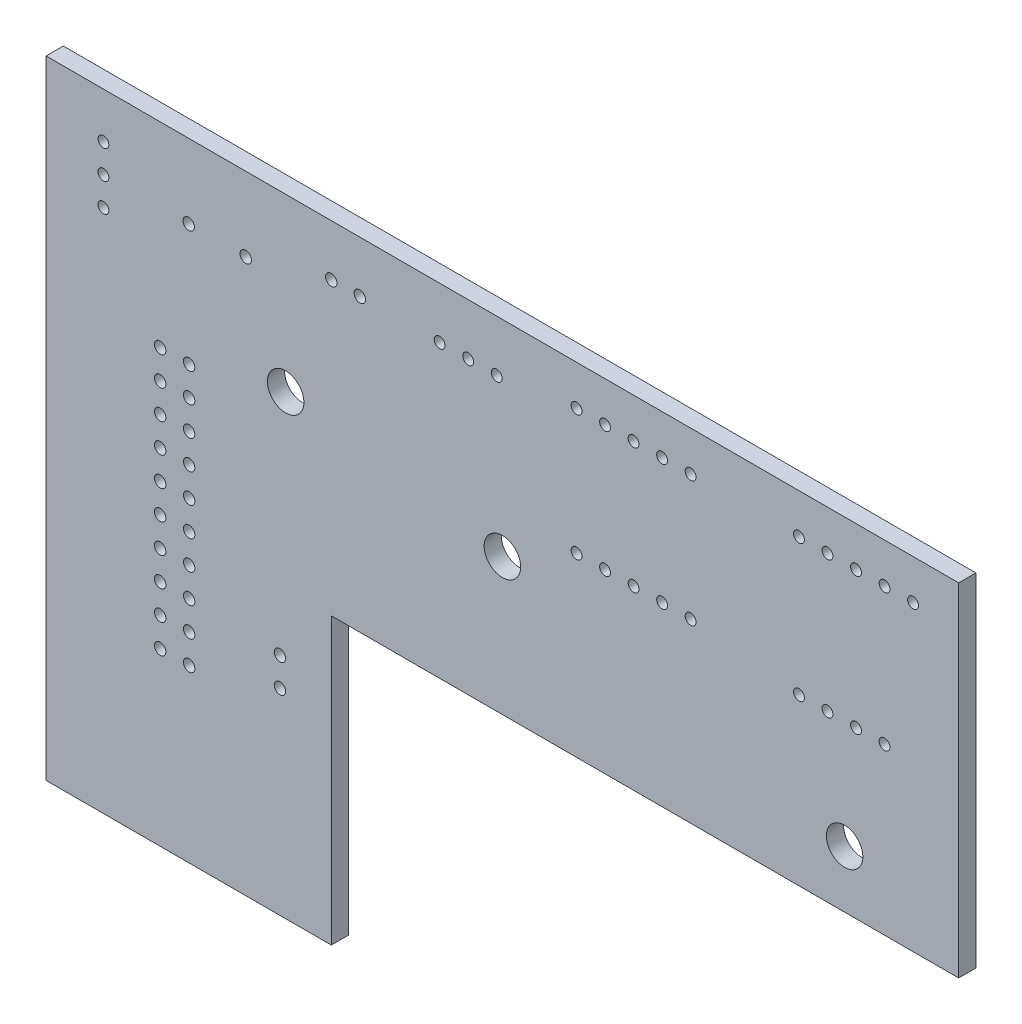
ISO-10303-21;
HEADER;
FILE_DESCRIPTION(('STEP AP214'),'2;1');
FILE_NAME('part.step','',(''),(''),'','','');
FILE_SCHEMA(('AUTOMOTIVE_DESIGN { 1 0 10303 214 1 1 1 1 }'));
ENDSEC;
DATA;
#1=APPLICATION_CONTEXT('core data for automotive mechanical design processes');
#2=APPLICATION_PROTOCOL_DEFINITION('international standard','automotive_design',2000,#1);
#3=PRODUCT_CONTEXT('',#1,'mechanical');
#4=PRODUCT('Part','Part','',(#3));
#5=PRODUCT_RELATED_PRODUCT_CATEGORY('part','',(#4));
#6=PRODUCT_DEFINITION_FORMATION('','',#4);
#7=PRODUCT_DEFINITION_CONTEXT('part definition',#1,'design');
#8=PRODUCT_DEFINITION('design','',#6,#7);
#9=PRODUCT_DEFINITION_SHAPE('','',#8);
#10=(LENGTH_UNIT() NAMED_UNIT(*) SI_UNIT(.MILLI.,.METRE.));
#11=(NAMED_UNIT(*) PLANE_ANGLE_UNIT() SI_UNIT($,.RADIAN.));
#12=(NAMED_UNIT(*) SI_UNIT($,.STERADIAN.) SOLID_ANGLE_UNIT());
#13=UNCERTAINTY_MEASURE_WITH_UNIT(LENGTH_MEASURE(1.E-05),#10,'distance_accuracy_value','');
#14=(GEOMETRIC_REPRESENTATION_CONTEXT(3) GLOBAL_UNCERTAINTY_ASSIGNED_CONTEXT((#13)) GLOBAL_UNIT_ASSIGNED_CONTEXT((#10,
#11,#12)) REPRESENTATION_CONTEXT('',''));
#15=CARTESIAN_POINT('',(0.,0.,0.));
#16=DIRECTION('',(0.,0.,1.));
#17=DIRECTION('',(1.,0.,0.));
#18=AXIS2_PLACEMENT_3D('',#15,#16,#17);
#19=CARTESIAN_POINT('',(96.,-23.5,-0.046));
#20=DIRECTION('',(0.,0.,-1.));
#21=DIRECTION('',(0.,-1.,0.));
#22=AXIS2_PLACEMENT_3D('',#19,#20,#21);
#23=CYLINDRICAL_SURFACE('',#22,0.475);
#24=CARTESIAN_POINT('',(96.,-23.5,0.));
#25=DIRECTION('',(0.,0.,-1.));
#26=DIRECTION('',(0.,-1.,0.));
#27=AXIS2_PLACEMENT_3D('',#24,#25,#26);
#28=CIRCLE('',#27,0.475);
#29=CARTESIAN_POINT('',(96.,-23.975,0.));
#30=VERTEX_POINT('',#29);
#31=EDGE_CURVE('E550',#30,#30,#28,.T.);
#32=ORIENTED_EDGE('',*,*,#31,.T.);
#33=DIRECTION('',(0.,0.,1.));
#34=VECTOR('',#33,1.);
#35=CARTESIAN_POINT('',(96.,-23.975,-0.046));
#36=LINE('',#35,#34);
#37=CARTESIAN_POINT('',(96.,-23.975,1.51));
#38=VERTEX_POINT('',#37);
#39=EDGE_CURVE('E11',#30,#38,#36,.T.);
#40=ORIENTED_EDGE('',*,*,#39,.T.);
#41=CARTESIAN_POINT('',(96.,-23.5,1.51));
#42=DIRECTION('',(0.,0.,-1.));
#43=DIRECTION('',(0.,-1.,0.));
#44=AXIS2_PLACEMENT_3D('',#41,#42,#43);
#45=CIRCLE('',#44,0.475);
#46=EDGE_CURVE('E697',#38,#38,#45,.T.);
#47=ORIENTED_EDGE('',*,*,#46,.F.);
#48=ORIENTED_EDGE('',*,*,#39,.F.);
#49=EDGE_LOOP('',(#32,#40,#47,#48));
#50=FACE_BOUND('',#49,.T.);
#51=ADVANCED_FACE('F17',(#50),#23,.F.);
#52=CARTESIAN_POINT('',(93.5,-23.5,-0.046));
#53=DIRECTION('',(0.,0.,-1.));
#54=DIRECTION('',(0.,-1.,0.));
#55=AXIS2_PLACEMENT_3D('',#52,#53,#54);
#56=CYLINDRICAL_SURFACE('',#55,0.475);
#57=CARTESIAN_POINT('',(93.5,-23.5,0.));
#58=DIRECTION('',(0.,0.,-1.));
#59=DIRECTION('',(0.,-1.,0.));
#60=AXIS2_PLACEMENT_3D('',#57,#58,#59);
#61=CIRCLE('',#60,0.475);
#62=CARTESIAN_POINT('',(93.5,-23.975,0.));
#63=VERTEX_POINT('',#62);
#64=EDGE_CURVE('E640',#63,#63,#61,.T.);
#65=ORIENTED_EDGE('',*,*,#64,.T.);
#66=DIRECTION('',(0.,0.,1.));
#67=VECTOR('',#66,1.);
#68=CARTESIAN_POINT('',(93.5,-23.975,-0.046));
#69=LINE('',#68,#67);
#70=CARTESIAN_POINT('',(93.5,-23.975,1.51));
#71=VERTEX_POINT('',#70);
#72=EDGE_CURVE('E26',#63,#71,#69,.T.);
#73=ORIENTED_EDGE('',*,*,#72,.T.);
#74=CARTESIAN_POINT('',(93.5,-23.5,1.51));
#75=DIRECTION('',(0.,0.,-1.));
#76=DIRECTION('',(0.,-1.,0.));
#77=AXIS2_PLACEMENT_3D('',#74,#75,#76);
#78=CIRCLE('',#77,0.475);
#79=EDGE_CURVE('E768',#71,#71,#78,.T.);
#80=ORIENTED_EDGE('',*,*,#79,.F.);
#81=ORIENTED_EDGE('',*,*,#72,.F.);
#82=EDGE_LOOP('',(#65,#73,#80,#81));
#83=FACE_BOUND('',#82,.T.);
#84=ADVANCED_FACE('F19',(#83),#56,.F.);
#85=CARTESIAN_POINT('',(91.,-23.5,-0.046));
#86=DIRECTION('',(0.,0.,-1.));
#87=DIRECTION('',(0.,-1.,0.));
#88=AXIS2_PLACEMENT_3D('',#85,#86,#87);
#89=CYLINDRICAL_SURFACE('',#88,0.475);
#90=CARTESIAN_POINT('',(91.,-23.5,0.));
#91=DIRECTION('',(0.,0.,-1.));
#92=DIRECTION('',(0.,-1.,0.));
#93=AXIS2_PLACEMENT_3D('',#90,#91,#92);
#94=CIRCLE('',#93,0.475);
#95=CARTESIAN_POINT('',(91.,-23.975,0.));
#96=VERTEX_POINT('',#95);
#97=EDGE_CURVE('E636',#96,#96,#94,.T.);
#98=ORIENTED_EDGE('',*,*,#97,.T.);
#99=DIRECTION('',(0.,0.,1.));
#100=VECTOR('',#99,1.);
#101=CARTESIAN_POINT('',(91.,-23.975,-0.046));
#102=LINE('',#101,#100);
#103=CARTESIAN_POINT('',(91.,-23.975,1.51));
#104=VERTEX_POINT('',#103);
#105=EDGE_CURVE('E823',#96,#104,#102,.T.);
#106=ORIENTED_EDGE('',*,*,#105,.T.);
#107=CARTESIAN_POINT('',(91.,-23.5,1.51));
#108=DIRECTION('',(0.,0.,-1.));
#109=DIRECTION('',(0.,-1.,0.));
#110=AXIS2_PLACEMENT_3D('',#107,#108,#109);
#111=CIRCLE('',#110,0.475);
#112=EDGE_CURVE('E764',#104,#104,#111,.T.);
#113=ORIENTED_EDGE('',*,*,#112,.F.);
#114=ORIENTED_EDGE('',*,*,#105,.F.);
#115=EDGE_LOOP('',(#98,#106,#113,#114));
#116=FACE_BOUND('',#115,.T.);
#117=ADVANCED_FACE('F1739',(#116),#89,.F.);
#118=CARTESIAN_POINT('',(88.5,-23.5,-0.046));
#119=DIRECTION('',(0.,0.,-1.));
#120=DIRECTION('',(0.,-1.,0.));
#121=AXIS2_PLACEMENT_3D('',#118,#119,#120);
#122=CYLINDRICAL_SURFACE('',#121,0.475);
#123=CARTESIAN_POINT('',(88.5,-23.5,0.));
#124=DIRECTION('',(0.,0.,-1.));
#125=DIRECTION('',(0.,-1.,0.));
#126=AXIS2_PLACEMENT_3D('',#123,#124,#125);
#127=CIRCLE('',#126,0.475);
#128=CARTESIAN_POINT('',(88.5,-23.975,0.));
#129=VERTEX_POINT('',#128);
#130=EDGE_CURVE('E635',#129,#129,#127,.T.);
#131=ORIENTED_EDGE('',*,*,#130,.T.);
#132=DIRECTION('',(0.,0.,1.));
#133=VECTOR('',#132,1.);
#134=CARTESIAN_POINT('',(88.5,-23.975,-0.046));
#135=LINE('',#134,#133);
#136=CARTESIAN_POINT('',(88.5,-23.975,1.51));
#137=VERTEX_POINT('',#136);
#138=EDGE_CURVE('E826',#129,#137,#135,.T.);
#139=ORIENTED_EDGE('',*,*,#138,.T.);
#140=CARTESIAN_POINT('',(88.5,-23.5,1.51));
#141=DIRECTION('',(0.,0.,-1.));
#142=DIRECTION('',(0.,-1.,0.));
#143=AXIS2_PLACEMENT_3D('',#140,#141,#142);
#144=CIRCLE('',#143,0.475);
#145=EDGE_CURVE('E657',#137,#137,#144,.T.);
#146=ORIENTED_EDGE('',*,*,#145,.F.);
#147=ORIENTED_EDGE('',*,*,#138,.F.);
#148=EDGE_LOOP('',(#131,#139,#146,#147));
#149=FACE_BOUND('',#148,.T.);
#150=ADVANCED_FACE('F1777',(#149),#122,.F.);
#151=CARTESIAN_POINT('',(86.,-23.5,-0.046));
#152=DIRECTION('',(0.,0.,-1.));
#153=DIRECTION('',(0.,-1.,0.));
#154=AXIS2_PLACEMENT_3D('',#151,#152,#153);
#155=CYLINDRICAL_SURFACE('',#154,0.475);
#156=CARTESIAN_POINT('',(86.,-23.5,0.));
#157=DIRECTION('',(0.,0.,-1.));
#158=DIRECTION('',(0.,-1.,0.));
#159=AXIS2_PLACEMENT_3D('',#156,#157,#158);
#160=CIRCLE('',#159,0.475);
#161=CARTESIAN_POINT('',(86.,-23.975,0.));
#162=VERTEX_POINT('',#161);
#163=EDGE_CURVE('E631',#162,#162,#160,.T.);
#164=ORIENTED_EDGE('',*,*,#163,.T.);
#165=DIRECTION('',(0.,0.,1.));
#166=VECTOR('',#165,1.);
#167=CARTESIAN_POINT('',(86.,-23.975,-0.046));
#168=LINE('',#167,#166);
#169=CARTESIAN_POINT('',(86.,-23.975,1.51));
#170=VERTEX_POINT('',#169);
#171=EDGE_CURVE('E906',#162,#170,#168,.T.);
#172=ORIENTED_EDGE('',*,*,#171,.T.);
#173=CARTESIAN_POINT('',(86.,-23.5,1.51));
#174=DIRECTION('',(0.,0.,-1.));
#175=DIRECTION('',(0.,-1.,0.));
#176=AXIS2_PLACEMENT_3D('',#173,#174,#175);
#177=CIRCLE('',#176,0.475);
#178=EDGE_CURVE('E653',#170,#170,#177,.T.);
#179=ORIENTED_EDGE('',*,*,#178,.F.);
#180=ORIENTED_EDGE('',*,*,#171,.F.);
#181=EDGE_LOOP('',(#164,#172,#179,#180));
#182=FACE_BOUND('',#181,.T.);
#183=ADVANCED_FACE('F1780',(#182),#155,.F.);
#184=CARTESIAN_POINT('',(76.5,-23.5,-0.046));
#185=DIRECTION('',(0.,0.,-1.));
#186=DIRECTION('',(0.,-1.,0.));
#187=AXIS2_PLACEMENT_3D('',#184,#185,#186);
#188=CYLINDRICAL_SURFACE('',#187,0.475);
#189=CARTESIAN_POINT('',(76.5,-23.5,0.));
#190=DIRECTION('',(0.,0.,-1.));
#191=DIRECTION('',(0.,-1.,0.));
#192=AXIS2_PLACEMENT_3D('',#189,#190,#191);
#193=CIRCLE('',#192,0.475);
#194=CARTESIAN_POINT('',(76.5,-23.975,0.));
#195=VERTEX_POINT('',#194);
#196=EDGE_CURVE('E614',#195,#195,#193,.T.);
#197=ORIENTED_EDGE('',*,*,#196,.T.);
#198=DIRECTION('',(0.,0.,1.));
#199=VECTOR('',#198,1.);
#200=CARTESIAN_POINT('',(76.5,-23.975,-0.046));
#201=LINE('',#200,#199);
#202=CARTESIAN_POINT('',(76.5,-23.975,1.51));
#203=VERTEX_POINT('',#202);
#204=EDGE_CURVE('E903',#195,#203,#201,.T.);
#205=ORIENTED_EDGE('',*,*,#204,.T.);
#206=CARTESIAN_POINT('',(76.5,-23.5,1.51));
#207=DIRECTION('',(0.,0.,-1.));
#208=DIRECTION('',(0.,-1.,0.));
#209=AXIS2_PLACEMENT_3D('',#206,#207,#208);
#210=CIRCLE('',#209,0.475);
#211=EDGE_CURVE('E658',#203,#203,#210,.T.);
#212=ORIENTED_EDGE('',*,*,#211,.F.);
#213=ORIENTED_EDGE('',*,*,#204,.F.);
#214=EDGE_LOOP('',(#197,#205,#212,#213));
#215=FACE_BOUND('',#214,.T.);
#216=ADVANCED_FACE('F1928',(#215),#188,.F.);
#217=CARTESIAN_POINT('',(74.,-23.5,-0.046));
#218=DIRECTION('',(0.,0.,-1.));
#219=DIRECTION('',(0.,-1.,0.));
#220=AXIS2_PLACEMENT_3D('',#217,#218,#219);
#221=CYLINDRICAL_SURFACE('',#220,0.475);
#222=CARTESIAN_POINT('',(74.,-23.5,0.));
#223=DIRECTION('',(0.,0.,-1.));
#224=DIRECTION('',(0.,-1.,0.));
#225=AXIS2_PLACEMENT_3D('',#222,#223,#224);
#226=CIRCLE('',#225,0.475);
#227=CARTESIAN_POINT('',(74.,-23.975,0.));
#228=VERTEX_POINT('',#227);
#229=EDGE_CURVE('E610',#228,#228,#226,.T.);
#230=ORIENTED_EDGE('',*,*,#229,.T.);
#231=DIRECTION('',(0.,0.,1.));
#232=VECTOR('',#231,1.);
#233=CARTESIAN_POINT('',(74.,-23.975,-0.046));
#234=LINE('',#233,#232);
#235=CARTESIAN_POINT('',(74.,-23.975,1.51));
#236=VERTEX_POINT('',#235);
#237=EDGE_CURVE('E900',#228,#236,#234,.T.);
#238=ORIENTED_EDGE('',*,*,#237,.T.);
#239=CARTESIAN_POINT('',(74.,-23.5,1.51));
#240=DIRECTION('',(0.,0.,-1.));
#241=DIRECTION('',(0.,-1.,0.));
#242=AXIS2_PLACEMENT_3D('',#239,#240,#241);
#243=CIRCLE('',#242,0.475);
#244=EDGE_CURVE('E566',#236,#236,#243,.T.);
#245=ORIENTED_EDGE('',*,*,#244,.F.);
#246=ORIENTED_EDGE('',*,*,#237,.F.);
#247=EDGE_LOOP('',(#230,#238,#245,#246));
#248=FACE_BOUND('',#247,.T.);
#249=ADVANCED_FACE('F1880',(#248),#221,.F.);
#250=CARTESIAN_POINT('',(71.5,-23.5,-0.046));
#251=DIRECTION('',(0.,0.,-1.));
#252=DIRECTION('',(0.,-1.,0.));
#253=AXIS2_PLACEMENT_3D('',#250,#251,#252);
#254=CYLINDRICAL_SURFACE('',#253,0.475);
#255=CARTESIAN_POINT('',(71.5,-23.5,0.));
#256=DIRECTION('',(0.,0.,-1.));
#257=DIRECTION('',(0.,-1.,0.));
#258=AXIS2_PLACEMENT_3D('',#255,#256,#257);
#259=CIRCLE('',#258,0.475);
#260=CARTESIAN_POINT('',(71.5,-23.975,0.));
#261=VERTEX_POINT('',#260);
#262=EDGE_CURVE('E615',#261,#261,#259,.T.);
#263=ORIENTED_EDGE('',*,*,#262,.T.);
#264=DIRECTION('',(0.,0.,1.));
#265=VECTOR('',#264,1.);
#266=CARTESIAN_POINT('',(71.5,-23.975,-0.046));
#267=LINE('',#266,#265);
#268=CARTESIAN_POINT('',(71.5,-23.975,1.51));
#269=VERTEX_POINT('',#268);
#270=EDGE_CURVE('E897',#261,#269,#267,.T.);
#271=ORIENTED_EDGE('',*,*,#270,.T.);
#272=CARTESIAN_POINT('',(71.5,-23.5,1.51));
#273=DIRECTION('',(0.,0.,-1.));
#274=DIRECTION('',(0.,-1.,0.));
#275=AXIS2_PLACEMENT_3D('',#272,#273,#274);
#276=CIRCLE('',#275,0.475);
#277=EDGE_CURVE('E562',#269,#269,#276,.T.);
#278=ORIENTED_EDGE('',*,*,#277,.F.);
#279=ORIENTED_EDGE('',*,*,#270,.F.);
#280=EDGE_LOOP('',(#263,#271,#278,#279));
#281=FACE_BOUND('',#280,.T.);
#282=ADVANCED_FACE('F1876',(#281),#254,.F.);
#283=CARTESIAN_POINT('',(69.,-23.5,-0.046));
#284=DIRECTION('',(0.,0.,-1.));
#285=DIRECTION('',(0.,-1.,0.));
#286=AXIS2_PLACEMENT_3D('',#283,#284,#285);
#287=CYLINDRICAL_SURFACE('',#286,0.475);
#288=CARTESIAN_POINT('',(69.,-23.5,0.));
#289=DIRECTION('',(0.,0.,-1.));
#290=DIRECTION('',(0.,-1.,0.));
#291=AXIS2_PLACEMENT_3D('',#288,#289,#290);
#292=CIRCLE('',#291,0.475);
#293=CARTESIAN_POINT('',(69.,-23.975,0.));
#294=VERTEX_POINT('',#293);
#295=EDGE_CURVE('E624',#294,#294,#292,.T.);
#296=ORIENTED_EDGE('',*,*,#295,.T.);
#297=DIRECTION('',(0.,0.,1.));
#298=VECTOR('',#297,1.);
#299=CARTESIAN_POINT('',(69.,-23.975,-0.046));
#300=LINE('',#299,#298);
#301=CARTESIAN_POINT('',(69.,-23.975,1.51));
#302=VERTEX_POINT('',#301);
#303=EDGE_CURVE('E894',#294,#302,#300,.T.);
#304=ORIENTED_EDGE('',*,*,#303,.T.);
#305=CARTESIAN_POINT('',(69.,-23.5,1.51));
#306=DIRECTION('',(0.,0.,-1.));
#307=DIRECTION('',(0.,-1.,0.));
#308=AXIS2_PLACEMENT_3D('',#305,#306,#307);
#309=CIRCLE('',#308,0.475);
#310=EDGE_CURVE('E567',#302,#302,#309,.T.);
#311=ORIENTED_EDGE('',*,*,#310,.F.);
#312=ORIENTED_EDGE('',*,*,#303,.F.);
#313=EDGE_LOOP('',(#296,#304,#311,#312));
#314=FACE_BOUND('',#313,.T.);
#315=ADVANCED_FACE('F1879',(#314),#287,.F.);
#316=CARTESIAN_POINT('',(66.5,-23.5,-0.046));
#317=DIRECTION('',(0.,0.,-1.));
#318=DIRECTION('',(0.,-1.,0.));
#319=AXIS2_PLACEMENT_3D('',#316,#317,#318);
#320=CYLINDRICAL_SURFACE('',#319,0.475);
#321=CARTESIAN_POINT('',(66.5,-23.5,0.));
#322=DIRECTION('',(0.,0.,-1.));
#323=DIRECTION('',(0.,-1.,0.));
#324=AXIS2_PLACEMENT_3D('',#321,#322,#323);
#325=CIRCLE('',#324,0.475);
#326=CARTESIAN_POINT('',(66.5,-23.975,0.));
#327=VERTEX_POINT('',#326);
#328=EDGE_CURVE('E604',#327,#327,#325,.T.);
#329=ORIENTED_EDGE('',*,*,#328,.T.);
#330=DIRECTION('',(0.,0.,1.));
#331=VECTOR('',#330,1.);
#332=CARTESIAN_POINT('',(66.5,-23.975,-0.046));
#333=LINE('',#332,#331);
#334=CARTESIAN_POINT('',(66.5,-23.975,1.51));
#335=VERTEX_POINT('',#334);
#336=EDGE_CURVE('E891',#327,#335,#333,.T.);
#337=ORIENTED_EDGE('',*,*,#336,.T.);
#338=CARTESIAN_POINT('',(66.5,-23.5,1.51));
#339=DIRECTION('',(0.,0.,-1.));
#340=DIRECTION('',(0.,-1.,0.));
#341=AXIS2_PLACEMENT_3D('',#338,#339,#340);
#342=CIRCLE('',#341,0.475);
#343=EDGE_CURVE('E609',#335,#335,#342,.T.);
#344=ORIENTED_EDGE('',*,*,#343,.F.);
#345=ORIENTED_EDGE('',*,*,#336,.F.);
#346=EDGE_LOOP('',(#329,#337,#344,#345));
#347=FACE_BOUND('',#346,.T.);
#348=ADVANCED_FACE('F1918',(#347),#320,.F.);
#349=CARTESIAN_POINT('',(93.5,-35.5,-0.046));
#350=DIRECTION('',(0.,0.,-1.));
#351=DIRECTION('',(0.,-1.,0.));
#352=AXIS2_PLACEMENT_3D('',#349,#350,#351);
#353=CYLINDRICAL_SURFACE('',#352,0.475);
#354=CARTESIAN_POINT('',(93.5,-35.5,0.));
#355=DIRECTION('',(0.,0.,-1.));
#356=DIRECTION('',(0.,-1.,0.));
#357=AXIS2_PLACEMENT_3D('',#354,#355,#356);
#358=CIRCLE('',#357,0.475);
#359=CARTESIAN_POINT('',(93.5,-35.975,0.));
#360=VERTEX_POINT('',#359);
#361=EDGE_CURVE('E600',#360,#360,#358,.T.);
#362=ORIENTED_EDGE('',*,*,#361,.T.);
#363=DIRECTION('',(0.,0.,1.));
#364=VECTOR('',#363,1.);
#365=CARTESIAN_POINT('',(93.5,-35.975,-0.046));
#366=LINE('',#365,#364);
#367=CARTESIAN_POINT('',(93.5,-35.975,1.51));
#368=VERTEX_POINT('',#367);
#369=EDGE_CURVE('E888',#360,#368,#366,.T.);
#370=ORIENTED_EDGE('',*,*,#369,.T.);
#371=CARTESIAN_POINT('',(93.5,-35.5,1.51));
#372=DIRECTION('',(0.,0.,-1.));
#373=DIRECTION('',(0.,-1.,0.));
#374=AXIS2_PLACEMENT_3D('',#371,#372,#373);
#375=CIRCLE('',#374,0.475);
#376=EDGE_CURVE('E605',#368,#368,#375,.T.);
#377=ORIENTED_EDGE('',*,*,#376,.F.);
#378=ORIENTED_EDGE('',*,*,#369,.F.);
#379=EDGE_LOOP('',(#362,#370,#377,#378));
#380=FACE_BOUND('',#379,.T.);
#381=ADVANCED_FACE('F1747',(#380),#353,.F.);
#382=CARTESIAN_POINT('',(91.,-35.5,-0.046));
#383=DIRECTION('',(0.,0.,-1.));
#384=DIRECTION('',(0.,-1.,0.));
#385=AXIS2_PLACEMENT_3D('',#382,#383,#384);
#386=CYLINDRICAL_SURFACE('',#385,0.475);
#387=CARTESIAN_POINT('',(91.,-35.5,0.));
#388=DIRECTION('',(0.,0.,-1.));
#389=DIRECTION('',(0.,-1.,0.));
#390=AXIS2_PLACEMENT_3D('',#387,#388,#389);
#391=CIRCLE('',#390,0.475);
#392=CARTESIAN_POINT('',(91.,-35.975,0.));
#393=VERTEX_POINT('',#392);
#394=EDGE_CURVE('E599',#393,#393,#391,.T.);
#395=ORIENTED_EDGE('',*,*,#394,.T.);
#396=DIRECTION('',(0.,0.,1.));
#397=VECTOR('',#396,1.);
#398=CARTESIAN_POINT('',(91.,-35.975,-0.046));
#399=LINE('',#398,#397);
#400=CARTESIAN_POINT('',(91.,-35.975,1.51));
#401=VERTEX_POINT('',#400);
#402=EDGE_CURVE('E885',#393,#401,#399,.T.);
#403=ORIENTED_EDGE('',*,*,#402,.T.);
#404=CARTESIAN_POINT('',(91.,-35.5,1.51));
#405=DIRECTION('',(0.,0.,-1.));
#406=DIRECTION('',(0.,-1.,0.));
#407=AXIS2_PLACEMENT_3D('',#404,#405,#406);
#408=CIRCLE('',#407,0.475);
#409=EDGE_CURVE('E588',#401,#401,#408,.T.);
#410=ORIENTED_EDGE('',*,*,#409,.F.);
#411=ORIENTED_EDGE('',*,*,#402,.F.);
#412=EDGE_LOOP('',(#395,#403,#410,#411));
#413=FACE_BOUND('',#412,.T.);
#414=ADVANCED_FACE('F1743',(#413),#386,.F.);
#415=CARTESIAN_POINT('',(88.5,-35.5,-0.046));
#416=DIRECTION('',(0.,0.,-1.));
#417=DIRECTION('',(0.,-1.,0.));
#418=AXIS2_PLACEMENT_3D('',#415,#416,#417);
#419=CYLINDRICAL_SURFACE('',#418,0.475);
#420=CARTESIAN_POINT('',(88.5,-35.5,0.));
#421=DIRECTION('',(0.,0.,-1.));
#422=DIRECTION('',(0.,-1.,0.));
#423=AXIS2_PLACEMENT_3D('',#420,#421,#422);
#424=CIRCLE('',#423,0.475);
#425=CARTESIAN_POINT('',(88.5,-35.975,0.));
#426=VERTEX_POINT('',#425);
#427=EDGE_CURVE('E594',#426,#426,#424,.T.);
#428=ORIENTED_EDGE('',*,*,#427,.T.);
#429=DIRECTION('',(0.,0.,1.));
#430=VECTOR('',#429,1.);
#431=CARTESIAN_POINT('',(88.5,-35.975,-0.046));
#432=LINE('',#431,#430);
#433=CARTESIAN_POINT('',(88.5,-35.975,1.51));
#434=VERTEX_POINT('',#433);
#435=EDGE_CURVE('E882',#426,#434,#432,.T.);
#436=ORIENTED_EDGE('',*,*,#435,.T.);
#437=CARTESIAN_POINT('',(88.5,-35.5,1.51));
#438=DIRECTION('',(0.,0.,-1.));
#439=DIRECTION('',(0.,-1.,0.));
#440=AXIS2_PLACEMENT_3D('',#437,#438,#439);
#441=CIRCLE('',#440,0.475);
#442=EDGE_CURVE('E584',#434,#434,#441,.T.);
#443=ORIENTED_EDGE('',*,*,#442,.F.);
#444=ORIENTED_EDGE('',*,*,#435,.F.);
#445=EDGE_LOOP('',(#428,#436,#443,#444));
#446=FACE_BOUND('',#445,.T.);
#447=ADVANCED_FACE('F1746',(#446),#419,.F.);
#448=CARTESIAN_POINT('',(86.,-35.5,-0.046));
#449=DIRECTION('',(0.,0.,-1.));
#450=DIRECTION('',(0.,-1.,0.));
#451=AXIS2_PLACEMENT_3D('',#448,#449,#450);
#452=CYLINDRICAL_SURFACE('',#451,0.475);
#453=CARTESIAN_POINT('',(86.,-35.5,0.));
#454=DIRECTION('',(0.,0.,-1.));
#455=DIRECTION('',(0.,-1.,0.));
#456=AXIS2_PLACEMENT_3D('',#453,#454,#455);
#457=CIRCLE('',#456,0.475);
#458=CARTESIAN_POINT('',(86.,-35.975,0.));
#459=VERTEX_POINT('',#458);
#460=EDGE_CURVE('E590',#459,#459,#457,.T.);
#461=ORIENTED_EDGE('',*,*,#460,.T.);
#462=DIRECTION('',(0.,0.,1.));
#463=VECTOR('',#462,1.);
#464=CARTESIAN_POINT('',(86.,-35.975,-0.046));
#465=LINE('',#464,#463);
#466=CARTESIAN_POINT('',(86.,-35.975,1.51));
#467=VERTEX_POINT('',#466);
#468=EDGE_CURVE('E879',#459,#467,#465,.T.);
#469=ORIENTED_EDGE('',*,*,#468,.T.);
#470=CARTESIAN_POINT('',(86.,-35.5,1.51));
#471=DIRECTION('',(0.,0.,-1.));
#472=DIRECTION('',(0.,-1.,0.));
#473=AXIS2_PLACEMENT_3D('',#470,#471,#472);
#474=CIRCLE('',#473,0.475);
#475=EDGE_CURVE('E589',#467,#467,#474,.T.);
#476=ORIENTED_EDGE('',*,*,#475,.F.);
#477=ORIENTED_EDGE('',*,*,#468,.F.);
#478=EDGE_LOOP('',(#461,#469,#476,#477));
#479=FACE_BOUND('',#478,.T.);
#480=ADVANCED_FACE('F1823',(#479),#452,.F.);
#481=CARTESIAN_POINT('',(76.5,-34.5,-0.046));
#482=DIRECTION('',(0.,0.,-1.));
#483=DIRECTION('',(0.,-1.,0.));
#484=AXIS2_PLACEMENT_3D('',#481,#482,#483);
#485=CYLINDRICAL_SURFACE('',#484,0.475);
#486=CARTESIAN_POINT('',(76.5,-34.5,0.));
#487=DIRECTION('',(0.,0.,-1.));
#488=DIRECTION('',(0.,-1.,0.));
#489=AXIS2_PLACEMENT_3D('',#486,#487,#488);
#490=CIRCLE('',#489,0.475);
#491=CARTESIAN_POINT('',(76.5,-34.975,0.));
#492=VERTEX_POINT('',#491);
#493=EDGE_CURVE('E595',#492,#492,#490,.T.);
#494=ORIENTED_EDGE('',*,*,#493,.T.);
#495=DIRECTION('',(0.,0.,1.));
#496=VECTOR('',#495,1.);
#497=CARTESIAN_POINT('',(76.5,-34.975,-0.046));
#498=LINE('',#497,#496);
#499=CARTESIAN_POINT('',(76.5,-34.975,1.51));
#500=VERTEX_POINT('',#499);
#501=EDGE_CURVE('E876',#492,#500,#498,.T.);
#502=ORIENTED_EDGE('',*,*,#501,.T.);
#503=CARTESIAN_POINT('',(76.5,-34.5,1.51));
#504=DIRECTION('',(0.,0.,-1.));
#505=DIRECTION('',(0.,-1.,0.));
#506=AXIS2_PLACEMENT_3D('',#503,#504,#505);
#507=CIRCLE('',#506,0.475);
#508=EDGE_CURVE('E629',#500,#500,#507,.T.);
#509=ORIENTED_EDGE('',*,*,#508,.F.);
#510=ORIENTED_EDGE('',*,*,#501,.F.);
#511=EDGE_LOOP('',(#494,#502,#509,#510));
#512=FACE_BOUND('',#511,.T.);
#513=ADVANCED_FACE('F1819',(#512),#485,.F.);
#514=CARTESIAN_POINT('',(74.,-34.5,-0.046));
#515=DIRECTION('',(0.,0.,-1.));
#516=DIRECTION('',(0.,-1.,0.));
#517=AXIS2_PLACEMENT_3D('',#514,#515,#516);
#518=CYLINDRICAL_SURFACE('',#517,0.475);
#519=CARTESIAN_POINT('',(74.,-34.5,0.));
#520=DIRECTION('',(0.,0.,-1.));
#521=DIRECTION('',(0.,-1.,0.));
#522=AXIS2_PLACEMENT_3D('',#519,#520,#521);
#523=CIRCLE('',#522,0.475);
#524=CARTESIAN_POINT('',(74.,-34.975,0.));
#525=VERTEX_POINT('',#524);
#526=EDGE_CURVE('E1309',#525,#525,#523,.T.);
#527=ORIENTED_EDGE('',*,*,#526,.T.);
#528=DIRECTION('',(0.,0.,1.));
#529=VECTOR('',#528,1.);
#530=CARTESIAN_POINT('',(74.,-34.975,-0.046));
#531=LINE('',#530,#529);
#532=CARTESIAN_POINT('',(74.,-34.975,1.51));
#533=VERTEX_POINT('',#532);
#534=EDGE_CURVE('E873',#525,#533,#531,.T.);
#535=ORIENTED_EDGE('',*,*,#534,.T.);
#536=CARTESIAN_POINT('',(74.,-34.5,1.51));
#537=DIRECTION('',(0.,0.,-1.));
#538=DIRECTION('',(0.,-1.,0.));
#539=AXIS2_PLACEMENT_3D('',#536,#537,#538);
#540=CIRCLE('',#539,0.475);
#541=EDGE_CURVE('E625',#533,#533,#540,.T.);
#542=ORIENTED_EDGE('',*,*,#541,.F.);
#543=ORIENTED_EDGE('',*,*,#534,.F.);
#544=EDGE_LOOP('',(#527,#535,#542,#543));
#545=FACE_BOUND('',#544,.T.);
#546=ADVANCED_FACE('F1822',(#545),#518,.F.);
#547=CARTESIAN_POINT('',(71.5,-34.5,-0.046));
#548=DIRECTION('',(0.,0.,-1.));
#549=DIRECTION('',(0.,-1.,0.));
#550=AXIS2_PLACEMENT_3D('',#547,#548,#549);
#551=CYLINDRICAL_SURFACE('',#550,0.475);
#552=CARTESIAN_POINT('',(71.5,-34.5,0.));
#553=DIRECTION('',(0.,0.,-1.));
#554=DIRECTION('',(0.,-1.,0.));
#555=AXIS2_PLACEMENT_3D('',#552,#553,#554);
#556=CIRCLE('',#555,0.475);
#557=CARTESIAN_POINT('',(71.5,-34.975,0.));
#558=VERTEX_POINT('',#557);
#559=EDGE_CURVE('E1300',#558,#558,#556,.T.);
#560=ORIENTED_EDGE('',*,*,#559,.T.);
#561=DIRECTION('',(0.,0.,1.));
#562=VECTOR('',#561,1.);
#563=CARTESIAN_POINT('',(71.5,-34.975,-0.046));
#564=LINE('',#563,#562);
#565=CARTESIAN_POINT('',(71.5,-34.975,1.51));
#566=VERTEX_POINT('',#565);
#567=EDGE_CURVE('E870',#558,#566,#564,.T.);
#568=ORIENTED_EDGE('',*,*,#567,.T.);
#569=CARTESIAN_POINT('',(71.5,-34.5,1.51));
#570=DIRECTION('',(0.,0.,-1.));
#571=DIRECTION('',(0.,-1.,0.));
#572=AXIS2_PLACEMENT_3D('',#569,#570,#571);
#573=CIRCLE('',#572,0.475);
#574=EDGE_CURVE('E630',#566,#566,#573,.T.);
#575=ORIENTED_EDGE('',*,*,#574,.F.);
#576=ORIENTED_EDGE('',*,*,#567,.F.);
#577=EDGE_LOOP('',(#560,#568,#575,#576));
#578=FACE_BOUND('',#577,.T.);
#579=ADVANCED_FACE('F1865',(#578),#551,.F.);
#580=CARTESIAN_POINT('',(69.,-34.5,-0.046));
#581=DIRECTION('',(0.,0.,-1.));
#582=DIRECTION('',(0.,-1.,0.));
#583=AXIS2_PLACEMENT_3D('',#580,#581,#582);
#584=CYLINDRICAL_SURFACE('',#583,0.475);
#585=CARTESIAN_POINT('',(69.,-34.5,0.));
#586=DIRECTION('',(0.,0.,-1.));
#587=DIRECTION('',(0.,-1.,0.));
#588=AXIS2_PLACEMENT_3D('',#585,#586,#587);
#589=CIRCLE('',#588,0.475);
#590=CARTESIAN_POINT('',(69.,-34.975,0.));
#591=VERTEX_POINT('',#590);
#592=EDGE_CURVE('E583',#591,#591,#589,.T.);
#593=ORIENTED_EDGE('',*,*,#592,.T.);
#594=DIRECTION('',(0.,0.,1.));
#595=VECTOR('',#594,1.);
#596=CARTESIAN_POINT('',(69.,-34.975,-0.046));
#597=LINE('',#596,#595);
#598=CARTESIAN_POINT('',(69.,-34.975,1.51));
#599=VERTEX_POINT('',#598);
#600=EDGE_CURVE('E867',#591,#599,#597,.T.);
#601=ORIENTED_EDGE('',*,*,#600,.T.);
#602=CARTESIAN_POINT('',(69.,-34.5,1.51));
#603=DIRECTION('',(0.,0.,-1.));
#604=DIRECTION('',(0.,-1.,0.));
#605=AXIS2_PLACEMENT_3D('',#602,#603,#604);
#606=CIRCLE('',#605,0.475);
#607=EDGE_CURVE('E748',#599,#599,#606,.T.);
#608=ORIENTED_EDGE('',*,*,#607,.F.);
#609=ORIENTED_EDGE('',*,*,#600,.F.);
#610=EDGE_LOOP('',(#593,#601,#608,#609));
#611=FACE_BOUND('',#610,.T.);
#612=ADVANCED_FACE('F1861',(#611),#584,.F.);
#613=CARTESIAN_POINT('',(66.5,-34.5,-0.046));
#614=DIRECTION('',(0.,0.,-1.));
#615=DIRECTION('',(0.,-1.,0.));
#616=AXIS2_PLACEMENT_3D('',#613,#614,#615);
#617=CYLINDRICAL_SURFACE('',#616,0.475);
#618=CARTESIAN_POINT('',(66.5,-34.5,0.));
#619=DIRECTION('',(0.,0.,-1.));
#620=DIRECTION('',(0.,-1.,0.));
#621=AXIS2_PLACEMENT_3D('',#618,#619,#620);
#622=CIRCLE('',#621,0.475);
#623=CARTESIAN_POINT('',(66.5,-34.975,0.));
#624=VERTEX_POINT('',#623);
#625=EDGE_CURVE('E561',#624,#624,#622,.T.);
#626=ORIENTED_EDGE('',*,*,#625,.T.);
#627=DIRECTION('',(0.,0.,1.));
#628=VECTOR('',#627,1.);
#629=CARTESIAN_POINT('',(66.5,-34.975,-0.046));
#630=LINE('',#629,#628);
#631=CARTESIAN_POINT('',(66.5,-34.975,1.51));
#632=VERTEX_POINT('',#631);
#633=EDGE_CURVE('E864',#624,#632,#630,.T.);
#634=ORIENTED_EDGE('',*,*,#633,.T.);
#635=CARTESIAN_POINT('',(66.5,-34.5,1.51));
#636=DIRECTION('',(0.,0.,-1.));
#637=DIRECTION('',(0.,-1.,0.));
#638=AXIS2_PLACEMENT_3D('',#635,#636,#637);
#639=CIRCLE('',#638,0.475);
#640=EDGE_CURVE('E744',#632,#632,#639,.T.);
#641=ORIENTED_EDGE('',*,*,#640,.F.);
#642=ORIENTED_EDGE('',*,*,#633,.F.);
#643=EDGE_LOOP('',(#626,#634,#641,#642));
#644=FACE_BOUND('',#643,.T.);
#645=ADVANCED_FACE('F1864',(#644),#617,.F.);
#646=CARTESIAN_POINT('',(59.5,-24.5,-0.046));
#647=DIRECTION('',(0.,0.,-1.));
#648=DIRECTION('',(0.,-1.,0.));
#649=AXIS2_PLACEMENT_3D('',#646,#647,#648);
#650=CYLINDRICAL_SURFACE('',#649,0.475);
#651=CARTESIAN_POINT('',(59.5,-24.5,0.));
#652=DIRECTION('',(0.,0.,-1.));
#653=DIRECTION('',(0.,-1.,0.));
#654=AXIS2_PLACEMENT_3D('',#651,#652,#653);
#655=CIRCLE('',#654,0.475);
#656=CARTESIAN_POINT('',(59.5,-24.975,0.));
#657=VERTEX_POINT('',#656);
#658=EDGE_CURVE('E556',#657,#657,#655,.T.);
#659=ORIENTED_EDGE('',*,*,#658,.T.);
#660=DIRECTION('',(0.,0.,1.));
#661=VECTOR('',#660,1.);
#662=CARTESIAN_POINT('',(59.5,-24.975,-0.046));
#663=LINE('',#662,#661);
#664=CARTESIAN_POINT('',(59.5,-24.975,1.51));
#665=VERTEX_POINT('',#664);
#666=EDGE_CURVE('E861',#657,#665,#663,.T.);
#667=ORIENTED_EDGE('',*,*,#666,.T.);
#668=CARTESIAN_POINT('',(59.5,-24.5,1.51));
#669=DIRECTION('',(0.,0.,-1.));
#670=DIRECTION('',(0.,-1.,0.));
#671=AXIS2_PLACEMENT_3D('',#668,#669,#670);
#672=CIRCLE('',#671,0.475);
#673=EDGE_CURVE('E648',#665,#665,#672,.T.);
#674=ORIENTED_EDGE('',*,*,#673,.F.);
#675=ORIENTED_EDGE('',*,*,#666,.F.);
#676=EDGE_LOOP('',(#659,#667,#674,#675));
#677=FACE_BOUND('',#676,.T.);
#678=ADVANCED_FACE('F1899',(#677),#650,.F.);
#679=CARTESIAN_POINT('',(57.,-24.5,-0.046));
#680=DIRECTION('',(0.,0.,-1.));
#681=DIRECTION('',(0.,-1.,0.));
#682=AXIS2_PLACEMENT_3D('',#679,#680,#681);
#683=CYLINDRICAL_SURFACE('',#682,0.475);
#684=CARTESIAN_POINT('',(57.,-24.5,0.));
#685=DIRECTION('',(0.,0.,-1.));
#686=DIRECTION('',(0.,-1.,0.));
#687=AXIS2_PLACEMENT_3D('',#684,#685,#686);
#688=CIRCLE('',#687,0.475);
#689=CARTESIAN_POINT('',(57.,-24.975,0.));
#690=VERTEX_POINT('',#689);
#691=EDGE_CURVE('E552',#690,#690,#688,.T.);
#692=ORIENTED_EDGE('',*,*,#691,.T.);
#693=DIRECTION('',(0.,0.,1.));
#694=VECTOR('',#693,1.);
#695=CARTESIAN_POINT('',(57.,-24.975,-0.046));
#696=LINE('',#695,#694);
#697=CARTESIAN_POINT('',(57.,-24.975,1.51));
#698=VERTEX_POINT('',#697);
#699=EDGE_CURVE('E860',#690,#698,#696,.T.);
#700=ORIENTED_EDGE('',*,*,#699,.T.);
#701=CARTESIAN_POINT('',(57.,-24.5,1.51));
#702=DIRECTION('',(0.,0.,-1.));
#703=DIRECTION('',(0.,-1.,0.));
#704=AXIS2_PLACEMENT_3D('',#701,#702,#703);
#705=CIRCLE('',#704,0.475);
#706=EDGE_CURVE('E543',#698,#698,#705,.T.);
#707=ORIENTED_EDGE('',*,*,#706,.F.);
#708=ORIENTED_EDGE('',*,*,#699,.F.);
#709=EDGE_LOOP('',(#692,#700,#707,#708));
#710=FACE_BOUND('',#709,.T.);
#711=ADVANCED_FACE('F1896',(#710),#683,.F.);
#712=CARTESIAN_POINT('',(54.5,-24.5,-0.046));
#713=DIRECTION('',(0.,0.,-1.));
#714=DIRECTION('',(0.,-1.,0.));
#715=AXIS2_PLACEMENT_3D('',#712,#713,#714);
#716=CYLINDRICAL_SURFACE('',#715,0.475);
#717=CARTESIAN_POINT('',(54.5,-24.5,0.));
#718=DIRECTION('',(0.,0.,-1.));
#719=DIRECTION('',(0.,-1.,0.));
#720=AXIS2_PLACEMENT_3D('',#717,#718,#719);
#721=CIRCLE('',#720,0.475);
#722=CARTESIAN_POINT('',(54.5,-24.975,0.));
#723=VERTEX_POINT('',#722);
#724=EDGE_CURVE('E557',#723,#723,#721,.T.);
#725=ORIENTED_EDGE('',*,*,#724,.T.);
#726=DIRECTION('',(0.,0.,1.));
#727=VECTOR('',#726,1.);
#728=CARTESIAN_POINT('',(54.5,-24.975,-0.046));
#729=LINE('',#728,#727);
#730=CARTESIAN_POINT('',(54.5,-24.975,1.51));
#731=VERTEX_POINT('',#730);
#732=EDGE_CURVE('E527',#723,#731,#729,.T.);
#733=ORIENTED_EDGE('',*,*,#732,.T.);
#734=CARTESIAN_POINT('',(54.5,-24.5,1.51));
#735=DIRECTION('',(0.,0.,-1.));
#736=DIRECTION('',(0.,-1.,0.));
#737=AXIS2_PLACEMENT_3D('',#734,#735,#736);
#738=CIRCLE('',#737,0.475);
#739=EDGE_CURVE('E534',#731,#731,#738,.T.);
#740=ORIENTED_EDGE('',*,*,#739,.F.);
#741=ORIENTED_EDGE('',*,*,#732,.F.);
#742=EDGE_LOOP('',(#725,#733,#740,#741));
#743=FACE_BOUND('',#742,.T.);
#744=ADVANCED_FACE('F1895',(#743),#716,.F.);
#745=CARTESIAN_POINT('',(47.5,-24.5,-0.046));
#746=DIRECTION('',(0.,0.,-1.));
#747=DIRECTION('',(0.,-1.,0.));
#748=AXIS2_PLACEMENT_3D('',#745,#746,#747);
#749=CYLINDRICAL_SURFACE('',#748,0.5);
#750=CARTESIAN_POINT('',(47.5,-24.5,0.));
#751=DIRECTION('',(0.,0.,-1.));
#752=DIRECTION('',(0.,-1.,0.));
#753=AXIS2_PLACEMENT_3D('',#750,#751,#752);
#754=CIRCLE('',#753,0.5);
#755=CARTESIAN_POINT('',(47.5,-25.,0.));
#756=VERTEX_POINT('',#755);
#757=EDGE_CURVE('E525',#756,#756,#754,.T.);
#758=ORIENTED_EDGE('',*,*,#757,.T.);
#759=DIRECTION('',(0.,0.,1.));
#760=VECTOR('',#759,1.);
#761=CARTESIAN_POINT('',(47.5,-25.,-0.046));
#762=LINE('',#761,#760);
#763=CARTESIAN_POINT('',(47.5,-25.,1.51));
#764=VERTEX_POINT('',#763);
#765=EDGE_CURVE('E520',#756,#764,#762,.T.);
#766=ORIENTED_EDGE('',*,*,#765,.T.);
#767=CARTESIAN_POINT('',(47.5,-24.5,1.51));
#768=DIRECTION('',(0.,0.,-1.));
#769=DIRECTION('',(0.,-1.,0.));
#770=AXIS2_PLACEMENT_3D('',#767,#768,#769);
#771=CIRCLE('',#770,0.5);
#772=EDGE_CURVE('E523',#764,#764,#771,.T.);
#773=ORIENTED_EDGE('',*,*,#772,.F.);
#774=ORIENTED_EDGE('',*,*,#765,.F.);
#775=EDGE_LOOP('',(#758,#766,#773,#774));
#776=FACE_BOUND('',#775,.T.);
#777=ADVANCED_FACE('F522',(#776),#749,.F.);
#778=CARTESIAN_POINT('',(45.,-24.5,-0.046));
#779=DIRECTION('',(0.,0.,-1.));
#780=DIRECTION('',(0.,-1.,0.));
#781=AXIS2_PLACEMENT_3D('',#778,#779,#780);
#782=CYLINDRICAL_SURFACE('',#781,0.5);
#783=CARTESIAN_POINT('',(45.,-24.5,0.));
#784=DIRECTION('',(0.,0.,-1.));
#785=DIRECTION('',(0.,-1.,0.));
#786=AXIS2_PLACEMENT_3D('',#783,#784,#785);
#787=CIRCLE('',#786,0.5);
#788=CARTESIAN_POINT('',(45.,-25.,0.));
#789=VERTEX_POINT('',#788);
#790=EDGE_CURVE('E1264',#789,#789,#787,.T.);
#791=ORIENTED_EDGE('',*,*,#790,.T.);
#792=DIRECTION('',(0.,0.,1.));
#793=VECTOR('',#792,1.);
#794=CARTESIAN_POINT('',(45.,-25.,-0.046));
#795=LINE('',#794,#793);
#796=CARTESIAN_POINT('',(45.,-25.,1.51));
#797=VERTEX_POINT('',#796);
#798=EDGE_CURVE('E528',#789,#797,#795,.T.);
#799=ORIENTED_EDGE('',*,*,#798,.T.);
#800=CARTESIAN_POINT('',(45.,-24.5,1.51));
#801=DIRECTION('',(0.,0.,-1.));
#802=DIRECTION('',(0.,-1.,0.));
#803=AXIS2_PLACEMENT_3D('',#800,#801,#802);
#804=CIRCLE('',#803,0.5);
#805=EDGE_CURVE('E535',#797,#797,#804,.T.);
#806=ORIENTED_EDGE('',*,*,#805,.F.);
#807=ORIENTED_EDGE('',*,*,#798,.F.);
#808=EDGE_LOOP('',(#791,#799,#806,#807));
#809=FACE_BOUND('',#808,.T.);
#810=ADVANCED_FACE('F1888',(#809),#782,.F.);
#811=CARTESIAN_POINT('',(37.5,-26.5,-0.046));
#812=DIRECTION('',(0.,0.,-1.));
#813=DIRECTION('',(0.,-1.,0.));
#814=AXIS2_PLACEMENT_3D('',#811,#812,#813);
#815=CYLINDRICAL_SURFACE('',#814,0.5);
#816=CARTESIAN_POINT('',(37.5,-26.5,0.));
#817=DIRECTION('',(0.,0.,-1.));
#818=DIRECTION('',(0.,-1.,0.));
#819=AXIS2_PLACEMENT_3D('',#816,#817,#818);
#820=CIRCLE('',#819,0.5);
#821=CARTESIAN_POINT('',(37.5,-27.,0.));
#822=VERTEX_POINT('',#821);
#823=EDGE_CURVE('E1256',#822,#822,#820,.T.);
#824=ORIENTED_EDGE('',*,*,#823,.T.);
#825=DIRECTION('',(0.,0.,1.));
#826=VECTOR('',#825,1.);
#827=CARTESIAN_POINT('',(37.5,-27.,-0.046));
#828=LINE('',#827,#826);
#829=CARTESIAN_POINT('',(37.5,-27.,1.51));
#830=VERTEX_POINT('',#829);
#831=EDGE_CURVE('E853',#822,#830,#828,.T.);
#832=ORIENTED_EDGE('',*,*,#831,.T.);
#833=CARTESIAN_POINT('',(37.5,-26.5,1.51));
#834=DIRECTION('',(0.,0.,-1.));
#835=DIRECTION('',(0.,-1.,0.));
#836=AXIS2_PLACEMENT_3D('',#833,#834,#835);
#837=CIRCLE('',#836,0.5);
#838=EDGE_CURVE('E546',#830,#830,#837,.T.);
#839=ORIENTED_EDGE('',*,*,#838,.F.);
#840=ORIENTED_EDGE('',*,*,#831,.F.);
#841=EDGE_LOOP('',(#824,#832,#839,#840));
#842=FACE_BOUND('',#841,.T.);
#843=ADVANCED_FACE('F1884',(#842),#815,.F.);
#844=CARTESIAN_POINT('',(25.025,-24.,-0.046));
#845=DIRECTION('',(0.,0.,-1.));
#846=DIRECTION('',(0.,-1.,0.));
#847=AXIS2_PLACEMENT_3D('',#844,#845,#846);
#848=CYLINDRICAL_SURFACE('',#847,0.475);
#849=CARTESIAN_POINT('',(25.025,-24.,0.));
#850=DIRECTION('',(0.,0.,-1.));
#851=DIRECTION('',(0.,-1.,0.));
#852=AXIS2_PLACEMENT_3D('',#849,#850,#851);
#853=CIRCLE('',#852,0.475);
#854=CARTESIAN_POINT('',(25.025,-24.475,0.));
#855=VERTEX_POINT('',#854);
#856=EDGE_CURVE('E1248',#855,#855,#853,.T.);
#857=ORIENTED_EDGE('',*,*,#856,.T.);
#858=DIRECTION('',(0.,0.,1.));
#859=VECTOR('',#858,1.);
#860=CARTESIAN_POINT('',(25.025,-24.475,-0.046));
#861=LINE('',#860,#859);
#862=CARTESIAN_POINT('',(25.025,-24.475,1.51));
#863=VERTEX_POINT('',#862);
#864=EDGE_CURVE('E850',#855,#863,#861,.T.);
#865=ORIENTED_EDGE('',*,*,#864,.T.);
#866=CARTESIAN_POINT('',(25.025,-24.,1.51));
#867=DIRECTION('',(0.,0.,-1.));
#868=DIRECTION('',(0.,-1.,0.));
#869=AXIS2_PLACEMENT_3D('',#866,#867,#868);
#870=CIRCLE('',#869,0.475);
#871=EDGE_CURVE('E727',#863,#863,#870,.T.);
#872=ORIENTED_EDGE('',*,*,#871,.F.);
#873=ORIENTED_EDGE('',*,*,#864,.F.);
#874=EDGE_LOOP('',(#857,#865,#872,#873));
#875=FACE_BOUND('',#874,.T.);
#876=ADVANCED_FACE('F1852',(#875),#848,.F.);
#877=CARTESIAN_POINT('',(32.5,-26.5,-0.046));
#878=DIRECTION('',(0.,0.,-1.));
#879=DIRECTION('',(0.,-1.,0.));
#880=AXIS2_PLACEMENT_3D('',#877,#878,#879);
#881=CYLINDRICAL_SURFACE('',#880,0.5);
#882=CARTESIAN_POINT('',(32.5,-26.5,0.));
#883=DIRECTION('',(0.,0.,-1.));
#884=DIRECTION('',(0.,-1.,0.));
#885=AXIS2_PLACEMENT_3D('',#882,#883,#884);
#886=CIRCLE('',#885,0.5);
#887=CARTESIAN_POINT('',(32.5,-27.,0.));
#888=VERTEX_POINT('',#887);
#889=EDGE_CURVE('E1239',#888,#888,#886,.T.);
#890=ORIENTED_EDGE('',*,*,#889,.T.);
#891=DIRECTION('',(0.,0.,1.));
#892=VECTOR('',#891,1.);
#893=CARTESIAN_POINT('',(32.5,-27.,-0.046));
#894=LINE('',#893,#892);
#895=CARTESIAN_POINT('',(32.5,-27.,1.51));
#896=VERTEX_POINT('',#895);
#897=EDGE_CURVE('E847',#888,#896,#894,.T.);
#898=ORIENTED_EDGE('',*,*,#897,.T.);
#899=CARTESIAN_POINT('',(32.5,-26.5,1.51));
#900=DIRECTION('',(0.,0.,-1.));
#901=DIRECTION('',(0.,-1.,0.));
#902=AXIS2_PLACEMENT_3D('',#899,#900,#901);
#903=CIRCLE('',#902,0.5);
#904=EDGE_CURVE('E722',#896,#896,#903,.T.);
#905=ORIENTED_EDGE('',*,*,#904,.F.);
#906=ORIENTED_EDGE('',*,*,#897,.F.);
#907=EDGE_LOOP('',(#890,#898,#905,#906));
#908=FACE_BOUND('',#907,.T.);
#909=ADVANCED_FACE('F1848',(#908),#881,.F.);
#910=CARTESIAN_POINT('',(25.025,-26.5,-0.046));
#911=DIRECTION('',(0.,0.,-1.));
#912=DIRECTION('',(0.,-1.,0.));
#913=AXIS2_PLACEMENT_3D('',#910,#911,#912);
#914=CYLINDRICAL_SURFACE('',#913,0.475);
#915=CARTESIAN_POINT('',(25.025,-26.5,0.));
#916=DIRECTION('',(0.,0.,-1.));
#917=DIRECTION('',(0.,-1.,0.));
#918=AXIS2_PLACEMENT_3D('',#915,#916,#917);
#919=CIRCLE('',#918,0.475);
#920=CARTESIAN_POINT('',(25.025,-26.975,0.));
#921=VERTEX_POINT('',#920);
#922=EDGE_CURVE('E1231',#921,#921,#919,.T.);
#923=ORIENTED_EDGE('',*,*,#922,.T.);
#924=DIRECTION('',(0.,0.,1.));
#925=VECTOR('',#924,1.);
#926=CARTESIAN_POINT('',(25.025,-26.975,-0.046));
#927=LINE('',#926,#925);
#928=CARTESIAN_POINT('',(25.025,-26.975,1.51));
#929=VERTEX_POINT('',#928);
#930=EDGE_CURVE('E844',#921,#929,#927,.T.);
#931=ORIENTED_EDGE('',*,*,#930,.T.);
#932=CARTESIAN_POINT('',(25.025,-26.5,1.51));
#933=DIRECTION('',(0.,0.,-1.));
#934=DIRECTION('',(0.,-1.,0.));
#935=AXIS2_PLACEMENT_3D('',#932,#933,#934);
#936=CIRCLE('',#935,0.475);
#937=EDGE_CURVE('E718',#929,#929,#936,.T.);
#938=ORIENTED_EDGE('',*,*,#937,.F.);
#939=ORIENTED_EDGE('',*,*,#930,.F.);
#940=EDGE_LOOP('',(#923,#931,#938,#939));
#941=FACE_BOUND('',#940,.T.);
#942=ADVANCED_FACE('F1851',(#941),#914,.F.);
#943=CARTESIAN_POINT('',(25.025,-29.,-0.046));
#944=DIRECTION('',(0.,0.,-1.));
#945=DIRECTION('',(0.,-1.,0.));
#946=AXIS2_PLACEMENT_3D('',#943,#944,#945);
#947=CYLINDRICAL_SURFACE('',#946,0.475);
#948=CARTESIAN_POINT('',(25.025,-29.,0.));
#949=DIRECTION('',(0.,0.,-1.));
#950=DIRECTION('',(0.,-1.,0.));
#951=AXIS2_PLACEMENT_3D('',#948,#949,#950);
#952=CIRCLE('',#951,0.475);
#953=CARTESIAN_POINT('',(25.025,-29.475,0.));
#954=VERTEX_POINT('',#953);
#955=EDGE_CURVE('E1223',#954,#954,#952,.T.);
#956=ORIENTED_EDGE('',*,*,#955,.T.);
#957=DIRECTION('',(0.,0.,1.));
#958=VECTOR('',#957,1.);
#959=CARTESIAN_POINT('',(25.025,-29.475,-0.046));
#960=LINE('',#959,#958);
#961=CARTESIAN_POINT('',(25.025,-29.475,1.51));
#962=VERTEX_POINT('',#961);
#963=EDGE_CURVE('E841',#954,#962,#960,.T.);
#964=ORIENTED_EDGE('',*,*,#963,.T.);
#965=CARTESIAN_POINT('',(25.025,-29.,1.51));
#966=DIRECTION('',(0.,0.,-1.));
#967=DIRECTION('',(0.,-1.,0.));
#968=AXIS2_PLACEMENT_3D('',#965,#966,#967);
#969=CIRCLE('',#968,0.475);
#970=EDGE_CURVE('E723',#962,#962,#969,.T.);
#971=ORIENTED_EDGE('',*,*,#970,.F.);
#972=ORIENTED_EDGE('',*,*,#963,.F.);
#973=EDGE_LOOP('',(#956,#964,#971,#972));
#974=FACE_BOUND('',#973,.T.);
#975=ADVANCED_FACE('F1857',(#974),#947,.F.);
#976=CARTESIAN_POINT('',(60.,-38.,-0.046));
#977=DIRECTION('',(0.,0.,-1.));
#978=DIRECTION('',(0.,-1.,0.));
#979=AXIS2_PLACEMENT_3D('',#976,#977,#978);
#980=CYLINDRICAL_SURFACE('',#979,1.6);
#981=CARTESIAN_POINT('',(60.,-38.,0.));
#982=DIRECTION('',(0.,0.,-1.));
#983=DIRECTION('',(0.,-1.,0.));
#984=AXIS2_PLACEMENT_3D('',#981,#982,#983);
#985=CIRCLE('',#984,1.6);
#986=CARTESIAN_POINT('',(60.,-39.6,0.));
#987=VERTEX_POINT('',#986);
#988=EDGE_CURVE('E1210',#987,#987,#985,.T.);
#989=ORIENTED_EDGE('',*,*,#988,.T.);
#990=DIRECTION('',(0.,0.,1.));
#991=VECTOR('',#990,1.);
#992=CARTESIAN_POINT('',(60.,-39.6,-0.046));
#993=LINE('',#992,#991);
#994=CARTESIAN_POINT('',(60.,-39.6,1.51));
#995=VERTEX_POINT('',#994);
#996=EDGE_CURVE('E838',#987,#995,#993,.T.);
#997=ORIENTED_EDGE('',*,*,#996,.T.);
#998=CARTESIAN_POINT('',(60.,-38.,1.51));
#999=DIRECTION('',(0.,0.,-1.));
#1000=DIRECTION('',(0.,-1.,0.));
#1001=AXIS2_PLACEMENT_3D('',#998,#999,#1000);
#1002=CIRCLE('',#1001,1.6);
#1003=EDGE_CURVE('E1612',#995,#995,#1002,.T.);
#1004=ORIENTED_EDGE('',*,*,#1003,.F.);
#1005=ORIENTED_EDGE('',*,*,#996,.F.);
#1006=EDGE_LOOP('',(#989,#997,#1004,#1005));
#1007=FACE_BOUND('',#1006,.T.);
#1008=ADVANCED_FACE('F1854',(#1007),#980,.F.);
#1009=CARTESIAN_POINT('',(41.,-35.,-0.046));
#1010=DIRECTION('',(0.,0.,-1.));
#1011=DIRECTION('',(0.,-1.,0.));
#1012=AXIS2_PLACEMENT_3D('',#1009,#1010,#1011);
#1013=CYLINDRICAL_SURFACE('',#1012,1.6);
#1014=CARTESIAN_POINT('',(41.,-35.,0.));
#1015=DIRECTION('',(0.,0.,-1.));
#1016=DIRECTION('',(0.,-1.,0.));
#1017=AXIS2_PLACEMENT_3D('',#1014,#1015,#1016);
#1018=CIRCLE('',#1017,1.6);
#1019=CARTESIAN_POINT('',(41.,-36.6,0.));
#1020=VERTEX_POINT('',#1019);
#1021=EDGE_CURVE('E1203',#1020,#1020,#1018,.T.);
#1022=ORIENTED_EDGE('',*,*,#1021,.T.);
#1023=DIRECTION('',(0.,0.,1.));
#1024=VECTOR('',#1023,1.);
#1025=CARTESIAN_POINT('',(41.,-36.6,-0.046));
#1026=LINE('',#1025,#1024);
#1027=CARTESIAN_POINT('',(41.,-36.6,1.51));
#1028=VERTEX_POINT('',#1027);
#1029=EDGE_CURVE('E835',#1020,#1028,#1026,.T.);
#1030=ORIENTED_EDGE('',*,*,#1029,.T.);
#1031=CARTESIAN_POINT('',(41.,-35.,1.51));
#1032=DIRECTION('',(0.,0.,-1.));
#1033=DIRECTION('',(0.,-1.,0.));
#1034=AXIS2_PLACEMENT_3D('',#1031,#1032,#1033);
#1035=CIRCLE('',#1034,1.6);
#1036=EDGE_CURVE('E1584',#1028,#1028,#1035,.T.);
#1037=ORIENTED_EDGE('',*,*,#1036,.F.);
#1038=ORIENTED_EDGE('',*,*,#1029,.F.);
#1039=EDGE_LOOP('',(#1022,#1030,#1037,#1038));
#1040=FACE_BOUND('',#1039,.T.);
#1041=ADVANCED_FACE('F1790',(#1040),#1013,.F.);
#1042=CARTESIAN_POINT('',(32.54,-37.14,-0.046));
#1043=DIRECTION('',(0.,0.,-1.));
#1044=DIRECTION('',(0.,-1.,0.));
#1045=AXIS2_PLACEMENT_3D('',#1042,#1043,#1044);
#1046=CYLINDRICAL_SURFACE('',#1045,0.5);
#1047=CARTESIAN_POINT('',(32.54,-37.14,0.));
#1048=DIRECTION('',(0.,0.,-1.));
#1049=DIRECTION('',(0.,-1.,0.));
#1050=AXIS2_PLACEMENT_3D('',#1047,#1048,#1049);
#1051=CIRCLE('',#1050,0.5);
#1052=CARTESIAN_POINT('',(32.54,-37.64,0.));
#1053=VERTEX_POINT('',#1052);
#1054=EDGE_CURVE('E1194',#1053,#1053,#1051,.T.);
#1055=ORIENTED_EDGE('',*,*,#1054,.T.);
#1056=DIRECTION('',(0.,0.,1.));
#1057=VECTOR('',#1056,1.);
#1058=CARTESIAN_POINT('',(32.54,-37.64,-0.046));
#1059=LINE('',#1058,#1057);
#1060=CARTESIAN_POINT('',(32.54,-37.64,1.51));
#1061=VERTEX_POINT('',#1060);
#1062=EDGE_CURVE('E832',#1053,#1061,#1059,.T.);
#1063=ORIENTED_EDGE('',*,*,#1062,.T.);
#1064=CARTESIAN_POINT('',(32.54,-37.14,1.51));
#1065=DIRECTION('',(0.,0.,-1.));
#1066=DIRECTION('',(0.,-1.,0.));
#1067=AXIS2_PLACEMENT_3D('',#1064,#1065,#1066);
#1068=CIRCLE('',#1067,0.5);
#1069=EDGE_CURVE('E1581',#1061,#1061,#1068,.T.);
#1070=ORIENTED_EDGE('',*,*,#1069,.F.);
#1071=ORIENTED_EDGE('',*,*,#1062,.F.);
#1072=EDGE_LOOP('',(#1055,#1063,#1070,#1071));
#1073=FACE_BOUND('',#1072,.T.);
#1074=ADVANCED_FACE('F1787',(#1073),#1046,.F.);
#1075=CARTESIAN_POINT('',(30.,-37.14,-0.046));
#1076=DIRECTION('',(0.,0.,-1.));
#1077=DIRECTION('',(0.,-1.,0.));
#1078=AXIS2_PLACEMENT_3D('',#1075,#1076,#1077);
#1079=CYLINDRICAL_SURFACE('',#1078,0.5);
#1080=CARTESIAN_POINT('',(30.,-37.14,0.));
#1081=DIRECTION('',(0.,0.,-1.));
#1082=DIRECTION('',(0.,-1.,0.));
#1083=AXIS2_PLACEMENT_3D('',#1080,#1081,#1082);
#1084=CIRCLE('',#1083,0.5);
#1085=CARTESIAN_POINT('',(30.,-37.64,0.));
#1086=VERTEX_POINT('',#1085);
#1087=EDGE_CURVE('E1189',#1086,#1086,#1084,.T.);
#1088=ORIENTED_EDGE('',*,*,#1087,.T.);
#1089=DIRECTION('',(0.,0.,1.));
#1090=VECTOR('',#1089,1.);
#1091=CARTESIAN_POINT('',(30.,-37.64,-0.046));
#1092=LINE('',#1091,#1090);
#1093=CARTESIAN_POINT('',(30.,-37.64,1.51));
#1094=VERTEX_POINT('',#1093);
#1095=EDGE_CURVE('E829',#1086,#1094,#1092,.T.);
#1096=ORIENTED_EDGE('',*,*,#1095,.T.);
#1097=CARTESIAN_POINT('',(30.,-37.14,1.51));
#1098=DIRECTION('',(0.,0.,-1.));
#1099=DIRECTION('',(0.,-1.,0.));
#1100=AXIS2_PLACEMENT_3D('',#1097,#1098,#1099);
#1101=CIRCLE('',#1100,0.5);
#1102=EDGE_CURVE('E717',#1094,#1094,#1101,.T.);
#1103=ORIENTED_EDGE('',*,*,#1102,.F.);
#1104=ORIENTED_EDGE('',*,*,#1095,.F.);
#1105=EDGE_LOOP('',(#1088,#1096,#1103,#1104));
#1106=FACE_BOUND('',#1105,.T.);
#1107=ADVANCED_FACE('F1654',(#1106),#1079,.F.);
#1108=CARTESIAN_POINT('',(32.54,-39.68,-0.046));
#1109=DIRECTION('',(0.,0.,-1.));
#1110=DIRECTION('',(0.,-1.,0.));
#1111=AXIS2_PLACEMENT_3D('',#1108,#1109,#1110);
#1112=CYLINDRICAL_SURFACE('',#1111,0.5);
#1113=CARTESIAN_POINT('',(32.54,-39.68,0.));
#1114=DIRECTION('',(0.,0.,-1.));
#1115=DIRECTION('',(0.,-1.,0.));
#1116=AXIS2_PLACEMENT_3D('',#1113,#1114,#1115);
#1117=CIRCLE('',#1116,0.5);
#1118=CARTESIAN_POINT('',(32.54,-40.18,0.));
#1119=VERTEX_POINT('',#1118);
#1120=EDGE_CURVE('E1195',#1119,#1119,#1117,.T.);
#1121=ORIENTED_EDGE('',*,*,#1120,.T.);
#1122=DIRECTION('',(0.,0.,1.));
#1123=VECTOR('',#1122,1.);
#1124=CARTESIAN_POINT('',(32.54,-40.18,-0.046));
#1125=LINE('',#1124,#1123);
#1126=CARTESIAN_POINT('',(32.54,-40.18,1.51));
#1127=VERTEX_POINT('',#1126);
#1128=EDGE_CURVE('E822',#1119,#1127,#1125,.T.);
#1129=ORIENTED_EDGE('',*,*,#1128,.T.);
#1130=CARTESIAN_POINT('',(32.54,-39.68,1.51));
#1131=DIRECTION('',(0.,0.,-1.));
#1132=DIRECTION('',(0.,-1.,0.));
#1133=AXIS2_PLACEMENT_3D('',#1130,#1131,#1132);
#1134=CIRCLE('',#1133,0.5);
#1135=EDGE_CURVE('E713',#1127,#1127,#1134,.T.);
#1136=ORIENTED_EDGE('',*,*,#1135,.F.);
#1137=ORIENTED_EDGE('',*,*,#1128,.F.);
#1138=EDGE_LOOP('',(#1121,#1129,#1136,#1137));
#1139=FACE_BOUND('',#1138,.T.);
#1140=ADVANCED_FACE('F1843',(#1139),#1112,.F.);
#1141=CARTESIAN_POINT('',(30.,-39.68,-0.046));
#1142=DIRECTION('',(0.,0.,-1.));
#1143=DIRECTION('',(0.,-1.,0.));
#1144=AXIS2_PLACEMENT_3D('',#1141,#1142,#1143);
#1145=CYLINDRICAL_SURFACE('',#1144,0.5);
#1146=CARTESIAN_POINT('',(30.,-39.68,0.));
#1147=DIRECTION('',(0.,0.,-1.));
#1148=DIRECTION('',(0.,-1.,0.));
#1149=AXIS2_PLACEMENT_3D('',#1146,#1147,#1148);
#1150=CIRCLE('',#1149,0.5);
#1151=CARTESIAN_POINT('',(30.,-40.18,0.));
#1152=VERTEX_POINT('',#1151);
#1153=EDGE_CURVE('E1635',#1152,#1152,#1150,.T.);
#1154=ORIENTED_EDGE('',*,*,#1153,.T.);
#1155=DIRECTION('',(0.,0.,1.));
#1156=VECTOR('',#1155,1.);
#1157=CARTESIAN_POINT('',(30.,-40.18,-0.046));
#1158=LINE('',#1157,#1156);
#1159=CARTESIAN_POINT('',(30.,-40.18,1.51));
#1160=VERTEX_POINT('',#1159);
#1161=EDGE_CURVE('E819',#1152,#1160,#1158,.T.);
#1162=ORIENTED_EDGE('',*,*,#1161,.T.);
#1163=CARTESIAN_POINT('',(30.,-39.68,1.51));
#1164=DIRECTION('',(0.,0.,-1.));
#1165=DIRECTION('',(0.,-1.,0.));
#1166=AXIS2_PLACEMENT_3D('',#1163,#1164,#1165);
#1167=CIRCLE('',#1166,0.5);
#1168=EDGE_CURVE('E709',#1160,#1160,#1167,.T.);
#1169=ORIENTED_EDGE('',*,*,#1168,.F.);
#1170=ORIENTED_EDGE('',*,*,#1161,.F.);
#1171=EDGE_LOOP('',(#1154,#1162,#1169,#1170));
#1172=FACE_BOUND('',#1171,.T.);
#1173=ADVANCED_FACE('F1839',(#1172),#1145,.F.);
#1174=CARTESIAN_POINT('',(90.,-45.,-0.046));
#1175=DIRECTION('',(0.,0.,-1.));
#1176=DIRECTION('',(0.,-1.,0.));
#1177=AXIS2_PLACEMENT_3D('',#1174,#1175,#1176);
#1178=CYLINDRICAL_SURFACE('',#1177,1.6);
#1179=CARTESIAN_POINT('',(90.,-45.,0.));
#1180=DIRECTION('',(0.,0.,-1.));
#1181=DIRECTION('',(0.,-1.,0.));
#1182=AXIS2_PLACEMENT_3D('',#1179,#1180,#1181);
#1183=CIRCLE('',#1182,1.6);
#1184=CARTESIAN_POINT('',(90.,-46.6,0.));
#1185=VERTEX_POINT('',#1184);
#1186=EDGE_CURVE('E1603',#1185,#1185,#1183,.T.);
#1187=ORIENTED_EDGE('',*,*,#1186,.T.);
#1188=DIRECTION('',(0.,0.,1.));
#1189=VECTOR('',#1188,1.);
#1190=CARTESIAN_POINT('',(90.,-46.6,-0.046));
#1191=LINE('',#1190,#1189);
#1192=CARTESIAN_POINT('',(90.,-46.6,1.51));
#1193=VERTEX_POINT('',#1192);
#1194=EDGE_CURVE('E816',#1185,#1193,#1191,.T.);
#1195=ORIENTED_EDGE('',*,*,#1194,.T.);
#1196=CARTESIAN_POINT('',(90.,-45.,1.51));
#1197=DIRECTION('',(0.,0.,-1.));
#1198=DIRECTION('',(0.,-1.,0.));
#1199=AXIS2_PLACEMENT_3D('',#1196,#1197,#1198);
#1200=CIRCLE('',#1199,1.6);
#1201=EDGE_CURVE('E705',#1193,#1193,#1200,.T.);
#1202=ORIENTED_EDGE('',*,*,#1201,.F.);
#1203=ORIENTED_EDGE('',*,*,#1194,.F.);
#1204=EDGE_LOOP('',(#1187,#1195,#1202,#1203));
#1205=FACE_BOUND('',#1204,.T.);
#1206=ADVANCED_FACE('F1835',(#1205),#1178,.F.);
#1207=CARTESIAN_POINT('',(32.54,-42.22,-0.046));
#1208=DIRECTION('',(0.,0.,-1.));
#1209=DIRECTION('',(0.,-1.,0.));
#1210=AXIS2_PLACEMENT_3D('',#1207,#1208,#1209);
#1211=CYLINDRICAL_SURFACE('',#1210,0.5);
#1212=CARTESIAN_POINT('',(32.54,-42.22,0.));
#1213=DIRECTION('',(0.,0.,-1.));
#1214=DIRECTION('',(0.,-1.,0.));
#1215=AXIS2_PLACEMENT_3D('',#1212,#1213,#1214);
#1216=CIRCLE('',#1215,0.5);
#1217=CARTESIAN_POINT('',(32.54,-42.72,0.));
#1218=VERTEX_POINT('',#1217);
#1219=EDGE_CURVE('E1600',#1218,#1218,#1216,.T.);
#1220=ORIENTED_EDGE('',*,*,#1219,.T.);
#1221=DIRECTION('',(0.,0.,1.));
#1222=VECTOR('',#1221,1.);
#1223=CARTESIAN_POINT('',(32.54,-42.72,-0.046));
#1224=LINE('',#1223,#1222);
#1225=CARTESIAN_POINT('',(32.54,-42.72,1.51));
#1226=VERTEX_POINT('',#1225);
#1227=EDGE_CURVE('E813',#1218,#1226,#1224,.T.);
#1228=ORIENTED_EDGE('',*,*,#1227,.T.);
#1229=CARTESIAN_POINT('',(32.54,-42.22,1.51));
#1230=DIRECTION('',(0.,0.,-1.));
#1231=DIRECTION('',(0.,-1.,0.));
#1232=AXIS2_PLACEMENT_3D('',#1229,#1230,#1231);
#1233=CIRCLE('',#1232,0.5);
#1234=EDGE_CURVE('E704',#1226,#1226,#1233,.T.);
#1235=ORIENTED_EDGE('',*,*,#1234,.F.);
#1236=ORIENTED_EDGE('',*,*,#1227,.F.);
#1237=EDGE_LOOP('',(#1220,#1228,#1235,#1236));
#1238=FACE_BOUND('',#1237,.T.);
#1239=ADVANCED_FACE('F1831',(#1238),#1211,.F.);
#1240=CARTESIAN_POINT('',(30.,-42.22,-0.046));
#1241=DIRECTION('',(0.,0.,-1.));
#1242=DIRECTION('',(0.,-1.,0.));
#1243=AXIS2_PLACEMENT_3D('',#1240,#1241,#1242);
#1244=CYLINDRICAL_SURFACE('',#1243,0.5);
#1245=CARTESIAN_POINT('',(30.,-42.22,0.));
#1246=DIRECTION('',(0.,0.,-1.));
#1247=DIRECTION('',(0.,-1.,0.));
#1248=AXIS2_PLACEMENT_3D('',#1245,#1246,#1247);
#1249=CIRCLE('',#1248,0.5);
#1250=CARTESIAN_POINT('',(30.,-42.72,0.));
#1251=VERTEX_POINT('',#1250);
#1252=EDGE_CURVE('E1604',#1251,#1251,#1249,.T.);
#1253=ORIENTED_EDGE('',*,*,#1252,.T.);
#1254=DIRECTION('',(0.,0.,1.));
#1255=VECTOR('',#1254,1.);
#1256=CARTESIAN_POINT('',(30.,-42.72,-0.046));
#1257=LINE('',#1256,#1255);
#1258=CARTESIAN_POINT('',(30.,-42.72,1.51));
#1259=VERTEX_POINT('',#1258);
#1260=EDGE_CURVE('E810',#1251,#1259,#1257,.T.);
#1261=ORIENTED_EDGE('',*,*,#1260,.T.);
#1262=CARTESIAN_POINT('',(30.,-42.22,1.51));
#1263=DIRECTION('',(0.,0.,-1.));
#1264=DIRECTION('',(0.,-1.,0.));
#1265=AXIS2_PLACEMENT_3D('',#1262,#1263,#1264);
#1266=CIRCLE('',#1265,0.5);
#1267=EDGE_CURVE('E578',#1259,#1259,#1266,.T.);
#1268=ORIENTED_EDGE('',*,*,#1267,.F.);
#1269=ORIENTED_EDGE('',*,*,#1260,.F.);
#1270=EDGE_LOOP('',(#1253,#1261,#1268,#1269));
#1271=FACE_BOUND('',#1270,.T.);
#1272=ADVANCED_FACE('F1827',(#1271),#1244,.F.);
#1273=CARTESIAN_POINT('',(32.54,-44.76,-0.046));
#1274=DIRECTION('',(0.,0.,-1.));
#1275=DIRECTION('',(0.,-1.,0.));
#1276=AXIS2_PLACEMENT_3D('',#1273,#1274,#1275);
#1277=CYLINDRICAL_SURFACE('',#1276,0.5);
#1278=CARTESIAN_POINT('',(32.54,-44.76,0.));
#1279=DIRECTION('',(0.,0.,-1.));
#1280=DIRECTION('',(0.,-1.,0.));
#1281=AXIS2_PLACEMENT_3D('',#1278,#1279,#1280);
#1282=CIRCLE('',#1281,0.5);
#1283=CARTESIAN_POINT('',(32.54,-45.26,0.));
#1284=VERTEX_POINT('',#1283);
#1285=EDGE_CURVE('E1591',#1284,#1284,#1282,.T.);
#1286=ORIENTED_EDGE('',*,*,#1285,.T.);
#1287=DIRECTION('',(0.,0.,1.));
#1288=VECTOR('',#1287,1.);
#1289=CARTESIAN_POINT('',(32.54,-45.26,-0.046));
#1290=LINE('',#1289,#1288);
#1291=CARTESIAN_POINT('',(32.54,-45.26,1.51));
#1292=VERTEX_POINT('',#1291);
#1293=EDGE_CURVE('E807',#1284,#1292,#1290,.T.);
#1294=ORIENTED_EDGE('',*,*,#1293,.T.);
#1295=CARTESIAN_POINT('',(32.54,-44.76,1.51));
#1296=DIRECTION('',(0.,0.,-1.));
#1297=DIRECTION('',(0.,-1.,0.));
#1298=AXIS2_PLACEMENT_3D('',#1295,#1296,#1297);
#1299=CIRCLE('',#1298,0.5);
#1300=EDGE_CURVE('E574',#1292,#1292,#1299,.T.);
#1301=ORIENTED_EDGE('',*,*,#1300,.F.);
#1302=ORIENTED_EDGE('',*,*,#1293,.F.);
#1303=EDGE_LOOP('',(#1286,#1294,#1301,#1302));
#1304=FACE_BOUND('',#1303,.T.);
#1305=ADVANCED_FACE('F1814',(#1304),#1277,.F.);
#1306=CARTESIAN_POINT('',(30.,-44.76,-0.046));
#1307=DIRECTION('',(0.,0.,-1.));
#1308=DIRECTION('',(0.,-1.,0.));
#1309=AXIS2_PLACEMENT_3D('',#1306,#1307,#1308);
#1310=CYLINDRICAL_SURFACE('',#1309,0.5);
#1311=CARTESIAN_POINT('',(30.,-44.76,0.));
#1312=DIRECTION('',(0.,0.,-1.));
#1313=DIRECTION('',(0.,-1.,0.));
#1314=AXIS2_PLACEMENT_3D('',#1311,#1312,#1313);
#1315=CIRCLE('',#1314,0.5);
#1316=CARTESIAN_POINT('',(30.,-45.26,0.));
#1317=VERTEX_POINT('',#1316);
#1318=EDGE_CURVE('E1588',#1317,#1317,#1315,.T.);
#1319=ORIENTED_EDGE('',*,*,#1318,.T.);
#1320=DIRECTION('',(0.,0.,1.));
#1321=VECTOR('',#1320,1.);
#1322=CARTESIAN_POINT('',(30.,-45.26,-0.046));
#1323=LINE('',#1322,#1321);
#1324=CARTESIAN_POINT('',(30.,-45.26,1.51));
#1325=VERTEX_POINT('',#1324);
#1326=EDGE_CURVE('E804',#1317,#1325,#1323,.T.);
#1327=ORIENTED_EDGE('',*,*,#1326,.T.);
#1328=CARTESIAN_POINT('',(30.,-44.76,1.51));
#1329=DIRECTION('',(0.,0.,-1.));
#1330=DIRECTION('',(0.,-1.,0.));
#1331=AXIS2_PLACEMENT_3D('',#1328,#1329,#1330);
#1332=CIRCLE('',#1331,0.5);
#1333=EDGE_CURVE('E579',#1325,#1325,#1332,.T.);
#1334=ORIENTED_EDGE('',*,*,#1333,.F.);
#1335=ORIENTED_EDGE('',*,*,#1326,.F.);
#1336=EDGE_LOOP('',(#1319,#1327,#1334,#1335));
#1337=FACE_BOUND('',#1336,.T.);
#1338=ADVANCED_FACE('F1810',(#1337),#1310,.F.);
#1339=CARTESIAN_POINT('',(32.54,-47.3,-0.046));
#1340=DIRECTION('',(0.,0.,-1.));
#1341=DIRECTION('',(0.,-1.,0.));
#1342=AXIS2_PLACEMENT_3D('',#1339,#1340,#1341);
#1343=CYLINDRICAL_SURFACE('',#1342,0.5);
#1344=CARTESIAN_POINT('',(32.54,-47.3,0.));
#1345=DIRECTION('',(0.,0.,-1.));
#1346=DIRECTION('',(0.,-1.,0.));
#1347=AXIS2_PLACEMENT_3D('',#1344,#1345,#1346);
#1348=CIRCLE('',#1347,0.5);
#1349=CARTESIAN_POINT('',(32.54,-47.8,0.));
#1350=VERTEX_POINT('',#1349);
#1351=EDGE_CURVE('E1592',#1350,#1350,#1348,.T.);
#1352=ORIENTED_EDGE('',*,*,#1351,.T.);
#1353=DIRECTION('',(0.,0.,1.));
#1354=VECTOR('',#1353,1.);
#1355=CARTESIAN_POINT('',(32.54,-47.8,-0.046));
#1356=LINE('',#1355,#1354);
#1357=CARTESIAN_POINT('',(32.54,-47.8,1.51));
#1358=VERTEX_POINT('',#1357);
#1359=EDGE_CURVE('E801',#1350,#1358,#1356,.T.);
#1360=ORIENTED_EDGE('',*,*,#1359,.T.);
#1361=CARTESIAN_POINT('',(32.54,-47.3,1.51));
#1362=DIRECTION('',(0.,0.,-1.));
#1363=DIRECTION('',(0.,-1.,0.));
#1364=AXIS2_PLACEMENT_3D('',#1361,#1362,#1363);
#1365=CIRCLE('',#1364,0.5);
#1366=EDGE_CURVE('E691',#1358,#1358,#1365,.T.);
#1367=ORIENTED_EDGE('',*,*,#1366,.F.);
#1368=ORIENTED_EDGE('',*,*,#1359,.F.);
#1369=EDGE_LOOP('',(#1352,#1360,#1367,#1368));
#1370=FACE_BOUND('',#1369,.T.);
#1371=ADVANCED_FACE('F1761',(#1370),#1343,.F.);
#1372=CARTESIAN_POINT('',(30.,-47.3,-0.046));
#1373=DIRECTION('',(0.,0.,-1.));
#1374=DIRECTION('',(0.,-1.,0.));
#1375=AXIS2_PLACEMENT_3D('',#1372,#1373,#1374);
#1376=CYLINDRICAL_SURFACE('',#1375,0.5);
#1377=CARTESIAN_POINT('',(30.,-47.3,0.));
#1378=DIRECTION('',(0.,0.,-1.));
#1379=DIRECTION('',(0.,-1.,0.));
#1380=AXIS2_PLACEMENT_3D('',#1377,#1378,#1379);
#1381=CIRCLE('',#1380,0.5);
#1382=CARTESIAN_POINT('',(30.,-47.8,0.));
#1383=VERTEX_POINT('',#1382);
#1384=EDGE_CURVE('E1618',#1383,#1383,#1381,.T.);
#1385=ORIENTED_EDGE('',*,*,#1384,.T.);
#1386=DIRECTION('',(0.,0.,1.));
#1387=VECTOR('',#1386,1.);
#1388=CARTESIAN_POINT('',(30.,-47.8,-0.046));
#1389=LINE('',#1388,#1387);
#1390=CARTESIAN_POINT('',(30.,-47.8,1.51));
#1391=VERTEX_POINT('',#1390);
#1392=EDGE_CURVE('E798',#1383,#1391,#1389,.T.);
#1393=ORIENTED_EDGE('',*,*,#1392,.T.);
#1394=CARTESIAN_POINT('',(30.,-47.3,1.51));
#1395=DIRECTION('',(0.,0.,-1.));
#1396=DIRECTION('',(0.,-1.,0.));
#1397=AXIS2_PLACEMENT_3D('',#1394,#1395,#1396);
#1398=CIRCLE('',#1397,0.5);
#1399=EDGE_CURVE('E687',#1391,#1391,#1398,.T.);
#1400=ORIENTED_EDGE('',*,*,#1399,.F.);
#1401=ORIENTED_EDGE('',*,*,#1392,.F.);
#1402=EDGE_LOOP('',(#1385,#1393,#1400,#1401));
#1403=FACE_BOUND('',#1402,.T.);
#1404=ADVANCED_FACE('F1758',(#1403),#1376,.F.);
#1405=CARTESIAN_POINT('',(32.54,-49.84,-0.046));
#1406=DIRECTION('',(0.,0.,-1.));
#1407=DIRECTION('',(0.,-1.,0.));
#1408=AXIS2_PLACEMENT_3D('',#1405,#1406,#1407);
#1409=CYLINDRICAL_SURFACE('',#1408,0.5);
#1410=CARTESIAN_POINT('',(32.54,-49.84,0.));
#1411=DIRECTION('',(0.,0.,-1.));
#1412=DIRECTION('',(0.,-1.,0.));
#1413=AXIS2_PLACEMENT_3D('',#1410,#1411,#1412);
#1414=CIRCLE('',#1413,0.5);
#1415=CARTESIAN_POINT('',(32.54,-50.34,0.));
#1416=VERTEX_POINT('',#1415);
#1417=EDGE_CURVE('E1610',#1416,#1416,#1414,.T.);
#1418=ORIENTED_EDGE('',*,*,#1417,.T.);
#1419=DIRECTION('',(0.,0.,1.));
#1420=VECTOR('',#1419,1.);
#1421=CARTESIAN_POINT('',(32.54,-50.34,-0.046));
#1422=LINE('',#1421,#1420);
#1423=CARTESIAN_POINT('',(32.54,-50.34,1.51));
#1424=VERTEX_POINT('',#1423);
#1425=EDGE_CURVE('E795',#1416,#1424,#1422,.T.);
#1426=ORIENTED_EDGE('',*,*,#1425,.T.);
#1427=CARTESIAN_POINT('',(32.54,-49.84,1.51));
#1428=DIRECTION('',(0.,0.,-1.));
#1429=DIRECTION('',(0.,-1.,0.));
#1430=AXIS2_PLACEMENT_3D('',#1427,#1428,#1429);
#1431=CIRCLE('',#1430,0.5);
#1432=EDGE_CURVE('E692',#1424,#1424,#1431,.T.);
#1433=ORIENTED_EDGE('',*,*,#1432,.F.);
#1434=ORIENTED_EDGE('',*,*,#1425,.F.);
#1435=EDGE_LOOP('',(#1418,#1426,#1433,#1434));
#1436=FACE_BOUND('',#1435,.T.);
#1437=ADVANCED_FACE('F1753',(#1436),#1409,.F.);
#1438=CARTESIAN_POINT('',(30.,-49.84,-0.046));
#1439=DIRECTION('',(0.,0.,-1.));
#1440=DIRECTION('',(0.,-1.,0.));
#1441=AXIS2_PLACEMENT_3D('',#1438,#1439,#1440);
#1442=CYLINDRICAL_SURFACE('',#1441,0.5);
#1443=CARTESIAN_POINT('',(30.,-49.84,0.));
#1444=DIRECTION('',(0.,0.,-1.));
#1445=DIRECTION('',(0.,-1.,0.));
#1446=AXIS2_PLACEMENT_3D('',#1443,#1444,#1445);
#1447=CIRCLE('',#1446,0.5);
#1448=CARTESIAN_POINT('',(30.,-50.34,0.));
#1449=VERTEX_POINT('',#1448);
#1450=EDGE_CURVE('E1579',#1449,#1449,#1447,.T.);
#1451=ORIENTED_EDGE('',*,*,#1450,.T.);
#1452=DIRECTION('',(0.,0.,1.));
#1453=VECTOR('',#1452,1.);
#1454=CARTESIAN_POINT('',(30.,-50.34,-0.046));
#1455=LINE('',#1454,#1453);
#1456=CARTESIAN_POINT('',(30.,-50.34,1.51));
#1457=VERTEX_POINT('',#1456);
#1458=EDGE_CURVE('E792',#1449,#1457,#1455,.T.);
#1459=ORIENTED_EDGE('',*,*,#1458,.T.);
#1460=CARTESIAN_POINT('',(30.,-49.84,1.51));
#1461=DIRECTION('',(0.,0.,-1.));
#1462=DIRECTION('',(0.,-1.,0.));
#1463=AXIS2_PLACEMENT_3D('',#1460,#1461,#1462);
#1464=CIRCLE('',#1463,0.5);
#1465=EDGE_CURVE('E1217',#1457,#1457,#1464,.T.);
#1466=ORIENTED_EDGE('',*,*,#1465,.F.);
#1467=ORIENTED_EDGE('',*,*,#1458,.F.);
#1468=EDGE_LOOP('',(#1451,#1459,#1466,#1467));
#1469=FACE_BOUND('',#1468,.T.);
#1470=ADVANCED_FACE('F1749',(#1469),#1442,.F.);
#1471=CARTESIAN_POINT('',(40.5,-55.25,-0.046));
#1472=DIRECTION('',(0.,0.,-1.));
#1473=DIRECTION('',(0.,-1.,0.));
#1474=AXIS2_PLACEMENT_3D('',#1471,#1472,#1473);
#1475=CYLINDRICAL_SURFACE('',#1474,0.5);
#1476=CARTESIAN_POINT('',(40.5,-55.25,0.));
#1477=DIRECTION('',(0.,0.,-1.));
#1478=DIRECTION('',(0.,-1.,0.));
#1479=AXIS2_PLACEMENT_3D('',#1476,#1477,#1478);
#1480=CIRCLE('',#1479,0.5);
#1481=CARTESIAN_POINT('',(40.5,-55.75,0.));
#1482=VERTEX_POINT('',#1481);
#1483=EDGE_CURVE('E1576',#1482,#1482,#1480,.T.);
#1484=ORIENTED_EDGE('',*,*,#1483,.T.);
#1485=DIRECTION('',(0.,0.,1.));
#1486=VECTOR('',#1485,1.);
#1487=CARTESIAN_POINT('',(40.5,-55.75,-0.046));
#1488=LINE('',#1487,#1486);
#1489=CARTESIAN_POINT('',(40.5,-55.75,1.51));
#1490=VERTEX_POINT('',#1489);
#1491=EDGE_CURVE('E789',#1482,#1490,#1488,.T.);
#1492=ORIENTED_EDGE('',*,*,#1491,.T.);
#1493=CARTESIAN_POINT('',(40.5,-55.25,1.51));
#1494=DIRECTION('',(0.,0.,-1.));
#1495=DIRECTION('',(0.,-1.,0.));
#1496=AXIS2_PLACEMENT_3D('',#1493,#1494,#1495);
#1497=CIRCLE('',#1496,0.5);
#1498=EDGE_CURVE('E686',#1490,#1490,#1497,.T.);
#1499=ORIENTED_EDGE('',*,*,#1498,.F.);
#1500=ORIENTED_EDGE('',*,*,#1491,.F.);
#1501=EDGE_LOOP('',(#1484,#1492,#1499,#1500));
#1502=FACE_BOUND('',#1501,.T.);
#1503=ADVANCED_FACE('F1752',(#1502),#1475,.F.);
#1504=CARTESIAN_POINT('',(32.54,-52.38,-0.046));
#1505=DIRECTION('',(0.,0.,-1.));
#1506=DIRECTION('',(0.,-1.,0.));
#1507=AXIS2_PLACEMENT_3D('',#1504,#1505,#1506);
#1508=CYLINDRICAL_SURFACE('',#1507,0.5);
#1509=CARTESIAN_POINT('',(32.54,-52.38,0.));
#1510=DIRECTION('',(0.,0.,-1.));
#1511=DIRECTION('',(0.,-1.,0.));
#1512=AXIS2_PLACEMENT_3D('',#1509,#1510,#1511);
#1513=CIRCLE('',#1512,0.5);
#1514=CARTESIAN_POINT('',(32.54,-52.88,0.));
#1515=VERTEX_POINT('',#1514);
#1516=EDGE_CURVE('E1440',#1515,#1515,#1513,.T.);
#1517=ORIENTED_EDGE('',*,*,#1516,.T.);
#1518=DIRECTION('',(0.,0.,1.));
#1519=VECTOR('',#1518,1.);
#1520=CARTESIAN_POINT('',(32.54,-52.88,-0.046));
#1521=LINE('',#1520,#1519);
#1522=CARTESIAN_POINT('',(32.54,-52.88,1.51));
#1523=VERTEX_POINT('',#1522);
#1524=EDGE_CURVE('E786',#1515,#1523,#1521,.T.);
#1525=ORIENTED_EDGE('',*,*,#1524,.T.);
#1526=CARTESIAN_POINT('',(32.54,-52.38,1.51));
#1527=DIRECTION('',(0.,0.,-1.));
#1528=DIRECTION('',(0.,-1.,0.));
#1529=AXIS2_PLACEMENT_3D('',#1526,#1527,#1528);
#1530=CIRCLE('',#1529,0.5);
#1531=EDGE_CURVE('E682',#1523,#1523,#1530,.T.);
#1532=ORIENTED_EDGE('',*,*,#1531,.F.);
#1533=ORIENTED_EDGE('',*,*,#1524,.F.);
#1534=EDGE_LOOP('',(#1517,#1525,#1532,#1533));
#1535=FACE_BOUND('',#1534,.T.);
#1536=ADVANCED_FACE('F1797',(#1535),#1508,.F.);
#1537=CARTESIAN_POINT('',(30.,-52.38,-0.046));
#1538=DIRECTION('',(0.,0.,-1.));
#1539=DIRECTION('',(0.,-1.,0.));
#1540=AXIS2_PLACEMENT_3D('',#1537,#1538,#1539);
#1541=CYLINDRICAL_SURFACE('',#1540,0.5);
#1542=CARTESIAN_POINT('',(30.,-52.38,0.));
#1543=DIRECTION('',(0.,0.,-1.));
#1544=DIRECTION('',(0.,-1.,0.));
#1545=AXIS2_PLACEMENT_3D('',#1542,#1543,#1544);
#1546=CIRCLE('',#1545,0.5);
#1547=CARTESIAN_POINT('',(30.,-52.88,0.));
#1548=VERTEX_POINT('',#1547);
#1549=EDGE_CURVE('E1435',#1548,#1548,#1546,.T.);
#1550=ORIENTED_EDGE('',*,*,#1549,.T.);
#1551=DIRECTION('',(0.,0.,1.));
#1552=VECTOR('',#1551,1.);
#1553=CARTESIAN_POINT('',(30.,-52.88,-0.046));
#1554=LINE('',#1553,#1552);
#1555=CARTESIAN_POINT('',(30.,-52.88,1.51));
#1556=VERTEX_POINT('',#1555);
#1557=EDGE_CURVE('E783',#1548,#1556,#1554,.T.);
#1558=ORIENTED_EDGE('',*,*,#1557,.T.);
#1559=CARTESIAN_POINT('',(30.,-52.38,1.51));
#1560=DIRECTION('',(0.,0.,-1.));
#1561=DIRECTION('',(0.,-1.,0.));
#1562=AXIS2_PLACEMENT_3D('',#1559,#1560,#1561);
#1563=CIRCLE('',#1562,0.5);
#1564=EDGE_CURVE('E678',#1556,#1556,#1563,.T.);
#1565=ORIENTED_EDGE('',*,*,#1564,.F.);
#1566=ORIENTED_EDGE('',*,*,#1557,.F.);
#1567=EDGE_LOOP('',(#1550,#1558,#1565,#1566));
#1568=FACE_BOUND('',#1567,.T.);
#1569=ADVANCED_FACE('F1785',(#1568),#1541,.F.);
#1570=CARTESIAN_POINT('',(32.54,-54.92,-0.046));
#1571=DIRECTION('',(0.,0.,-1.));
#1572=DIRECTION('',(0.,-1.,0.));
#1573=AXIS2_PLACEMENT_3D('',#1570,#1571,#1572);
#1574=CYLINDRICAL_SURFACE('',#1573,0.5);
#1575=CARTESIAN_POINT('',(32.54,-54.92,0.));
#1576=DIRECTION('',(0.,0.,-1.));
#1577=DIRECTION('',(0.,-1.,0.));
#1578=AXIS2_PLACEMENT_3D('',#1575,#1576,#1577);
#1579=CIRCLE('',#1578,0.5);
#1580=CARTESIAN_POINT('',(32.54,-55.42,0.));
#1581=VERTEX_POINT('',#1580);
#1582=EDGE_CURVE('E1441',#1581,#1581,#1579,.T.);
#1583=ORIENTED_EDGE('',*,*,#1582,.T.);
#1584=DIRECTION('',(0.,0.,1.));
#1585=VECTOR('',#1584,1.);
#1586=CARTESIAN_POINT('',(32.54,-55.42,-0.046));
#1587=LINE('',#1586,#1585);
#1588=CARTESIAN_POINT('',(32.54,-55.42,1.51));
#1589=VERTEX_POINT('',#1588);
#1590=EDGE_CURVE('E619',#1581,#1589,#1587,.T.);
#1591=ORIENTED_EDGE('',*,*,#1590,.T.);
#1592=CARTESIAN_POINT('',(32.54,-54.92,1.51));
#1593=DIRECTION('',(0.,0.,-1.));
#1594=DIRECTION('',(0.,-1.,0.));
#1595=AXIS2_PLACEMENT_3D('',#1592,#1593,#1594);
#1596=CIRCLE('',#1595,0.5);
#1597=EDGE_CURVE('E674',#1589,#1589,#1596,.T.);
#1598=ORIENTED_EDGE('',*,*,#1597,.F.);
#1599=ORIENTED_EDGE('',*,*,#1590,.F.);
#1600=EDGE_LOOP('',(#1583,#1591,#1598,#1599));
#1601=FACE_BOUND('',#1600,.T.);
#1602=ADVANCED_FACE('F1782',(#1601),#1574,.F.);
#1603=CARTESIAN_POINT('',(30.,-54.92,-0.046));
#1604=DIRECTION('',(0.,0.,-1.));
#1605=DIRECTION('',(0.,-1.,0.));
#1606=AXIS2_PLACEMENT_3D('',#1603,#1604,#1605);
#1607=CYLINDRICAL_SURFACE('',#1606,0.5);
#1608=CARTESIAN_POINT('',(30.,-54.92,0.));
#1609=DIRECTION('',(0.,0.,-1.));
#1610=DIRECTION('',(0.,-1.,0.));
#1611=AXIS2_PLACEMENT_3D('',#1608,#1609,#1610);
#1612=CIRCLE('',#1611,0.5);
#1613=CARTESIAN_POINT('',(30.,-55.42,0.));
#1614=VERTEX_POINT('',#1613);
#1615=EDGE_CURVE('E1448',#1614,#1614,#1612,.T.);
#1616=ORIENTED_EDGE('',*,*,#1615,.T.);
#1617=DIRECTION('',(0.,0.,1.));
#1618=VECTOR('',#1617,1.);
#1619=CARTESIAN_POINT('',(30.,-55.42,-0.046));
#1620=LINE('',#1619,#1618);
#1621=CARTESIAN_POINT('',(30.,-55.42,1.51));
#1622=VERTEX_POINT('',#1621);
#1623=EDGE_CURVE('E616',#1614,#1622,#1620,.T.);
#1624=ORIENTED_EDGE('',*,*,#1623,.T.);
#1625=CARTESIAN_POINT('',(30.,-54.92,1.51));
#1626=DIRECTION('',(0.,0.,-1.));
#1627=DIRECTION('',(0.,-1.,0.));
#1628=AXIS2_PLACEMENT_3D('',#1625,#1626,#1627);
#1629=CIRCLE('',#1628,0.5);
#1630=EDGE_CURVE('E572',#1622,#1622,#1629,.T.);
#1631=ORIENTED_EDGE('',*,*,#1630,.F.);
#1632=ORIENTED_EDGE('',*,*,#1623,.F.);
#1633=EDGE_LOOP('',(#1616,#1624,#1631,#1632));
#1634=FACE_BOUND('',#1633,.T.);
#1635=ADVANCED_FACE('F1767',(#1634),#1607,.F.);
#1636=CARTESIAN_POINT('',(40.5,-57.75,-0.046));
#1637=DIRECTION('',(0.,0.,-1.));
#1638=DIRECTION('',(0.,-1.,0.));
#1639=AXIS2_PLACEMENT_3D('',#1636,#1637,#1638);
#1640=CYLINDRICAL_SURFACE('',#1639,0.5);
#1641=CARTESIAN_POINT('',(40.5,-57.75,0.));
#1642=DIRECTION('',(0.,0.,-1.));
#1643=DIRECTION('',(0.,-1.,0.));
#1644=AXIS2_PLACEMENT_3D('',#1641,#1642,#1643);
#1645=CIRCLE('',#1644,0.5);
#1646=CARTESIAN_POINT('',(40.5,-58.25,0.));
#1647=VERTEX_POINT('',#1646);
#1648=EDGE_CURVE('E1452',#1647,#1647,#1645,.T.);
#1649=ORIENTED_EDGE('',*,*,#1648,.T.);
#1650=DIRECTION('',(0.,0.,1.));
#1651=VECTOR('',#1650,1.);
#1652=CARTESIAN_POINT('',(40.5,-58.25,-0.046));
#1653=LINE('',#1652,#1651);
#1654=CARTESIAN_POINT('',(40.5,-58.25,1.51));
#1655=VERTEX_POINT('',#1654);
#1656=EDGE_CURVE('E620',#1647,#1655,#1653,.T.);
#1657=ORIENTED_EDGE('',*,*,#1656,.T.);
#1658=CARTESIAN_POINT('',(40.5,-57.75,1.51));
#1659=DIRECTION('',(0.,0.,-1.));
#1660=DIRECTION('',(0.,-1.,0.));
#1661=AXIS2_PLACEMENT_3D('',#1658,#1659,#1660);
#1662=CIRCLE('',#1661,0.5);
#1663=EDGE_CURVE('E568',#1655,#1655,#1662,.T.);
#1664=ORIENTED_EDGE('',*,*,#1663,.F.);
#1665=ORIENTED_EDGE('',*,*,#1656,.F.);
#1666=EDGE_LOOP('',(#1649,#1657,#1664,#1665));
#1667=FACE_BOUND('',#1666,.T.);
#1668=ADVANCED_FACE('F1763',(#1667),#1640,.F.);
#1669=CARTESIAN_POINT('',(32.54,-57.46,-0.046));
#1670=DIRECTION('',(0.,0.,-1.));
#1671=DIRECTION('',(0.,-1.,0.));
#1672=AXIS2_PLACEMENT_3D('',#1669,#1670,#1671);
#1673=CYLINDRICAL_SURFACE('',#1672,0.5);
#1674=CARTESIAN_POINT('',(32.54,-57.46,0.));
#1675=DIRECTION('',(0.,0.,-1.));
#1676=DIRECTION('',(0.,-1.,0.));
#1677=AXIS2_PLACEMENT_3D('',#1674,#1675,#1676);
#1678=CIRCLE('',#1677,0.5);
#1679=CARTESIAN_POINT('',(32.54,-57.96,0.));
#1680=VERTEX_POINT('',#1679);
#1681=EDGE_CURVE('E1456',#1680,#1680,#1678,.T.);
#1682=ORIENTED_EDGE('',*,*,#1681,.T.);
#1683=DIRECTION('',(0.,0.,1.));
#1684=VECTOR('',#1683,1.);
#1685=CARTESIAN_POINT('',(32.54,-57.96,-0.046));
#1686=LINE('',#1685,#1684);
#1687=CARTESIAN_POINT('',(32.54,-57.96,1.51));
#1688=VERTEX_POINT('',#1687);
#1689=EDGE_CURVE('E776',#1680,#1688,#1686,.T.);
#1690=ORIENTED_EDGE('',*,*,#1689,.T.);
#1691=CARTESIAN_POINT('',(32.54,-57.46,1.51));
#1692=DIRECTION('',(0.,0.,-1.));
#1693=DIRECTION('',(0.,-1.,0.));
#1694=AXIS2_PLACEMENT_3D('',#1691,#1692,#1693);
#1695=CIRCLE('',#1694,0.5);
#1696=EDGE_CURVE('E573',#1688,#1688,#1695,.T.);
#1697=ORIENTED_EDGE('',*,*,#1696,.F.);
#1698=ORIENTED_EDGE('',*,*,#1689,.F.);
#1699=EDGE_LOOP('',(#1682,#1690,#1697,#1698));
#1700=FACE_BOUND('',#1699,.T.);
#1701=ADVANCED_FACE('F1766',(#1700),#1673,.F.);
#1702=CARTESIAN_POINT('',(30.,-57.46,-0.046));
#1703=DIRECTION('',(0.,0.,-1.));
#1704=DIRECTION('',(0.,-1.,0.));
#1705=AXIS2_PLACEMENT_3D('',#1702,#1703,#1704);
#1706=CYLINDRICAL_SURFACE('',#1705,0.5);
#1707=CARTESIAN_POINT('',(30.,-57.46,0.));
#1708=DIRECTION('',(0.,0.,-1.));
#1709=DIRECTION('',(0.,-1.,0.));
#1710=AXIS2_PLACEMENT_3D('',#1707,#1708,#1709);
#1711=CIRCLE('',#1710,0.5);
#1712=CARTESIAN_POINT('',(30.,-57.96,0.));
#1713=VERTEX_POINT('',#1712);
#1714=EDGE_CURVE('E1464',#1713,#1713,#1711,.T.);
#1715=ORIENTED_EDGE('',*,*,#1714,.T.);
#1716=DIRECTION('',(0.,0.,1.));
#1717=VECTOR('',#1716,1.);
#1718=CARTESIAN_POINT('',(30.,-57.96,-0.046));
#1719=LINE('',#1718,#1717);
#1720=CARTESIAN_POINT('',(30.,-57.96,1.51));
#1721=VERTEX_POINT('',#1720);
#1722=EDGE_CURVE('E773',#1713,#1721,#1719,.T.);
#1723=ORIENTED_EDGE('',*,*,#1722,.T.);
#1724=CARTESIAN_POINT('',(30.,-57.46,1.51));
#1725=DIRECTION('',(0.,0.,-1.));
#1726=DIRECTION('',(0.,-1.,0.));
#1727=AXIS2_PLACEMENT_3D('',#1724,#1725,#1726);
#1728=CIRCLE('',#1727,0.5);
#1729=EDGE_CURVE('E670',#1721,#1721,#1728,.T.);
#1730=ORIENTED_EDGE('',*,*,#1729,.F.);
#1731=ORIENTED_EDGE('',*,*,#1722,.F.);
#1732=EDGE_LOOP('',(#1715,#1723,#1730,#1731));
#1733=FACE_BOUND('',#1732,.T.);
#1734=ADVANCED_FACE('F1771',(#1733),#1706,.F.);
#1735=CARTESIAN_POINT('',(32.54,-60.,-0.046));
#1736=DIRECTION('',(0.,0.,-1.));
#1737=DIRECTION('',(0.,-1.,0.));
#1738=AXIS2_PLACEMENT_3D('',#1735,#1736,#1737);
#1739=CYLINDRICAL_SURFACE('',#1738,0.5);
#1740=CARTESIAN_POINT('',(32.54,-60.,0.));
#1741=DIRECTION('',(0.,0.,-1.));
#1742=DIRECTION('',(0.,-1.,0.));
#1743=AXIS2_PLACEMENT_3D('',#1740,#1741,#1742);
#1744=CIRCLE('',#1743,0.5);
#1745=CARTESIAN_POINT('',(32.54,-60.5,0.));
#1746=VERTEX_POINT('',#1745);
#1747=EDGE_CURVE('E1470',#1746,#1746,#1744,.T.);
#1748=ORIENTED_EDGE('',*,*,#1747,.T.);
#1749=DIRECTION('',(0.,0.,1.));
#1750=VECTOR('',#1749,1.);
#1751=CARTESIAN_POINT('',(32.54,-60.5,-0.046));
#1752=LINE('',#1751,#1750);
#1753=CARTESIAN_POINT('',(32.54,-60.5,1.51));
#1754=VERTEX_POINT('',#1753);
#1755=EDGE_CURVE('E737',#1746,#1754,#1752,.T.);
#1756=ORIENTED_EDGE('',*,*,#1755,.T.);
#1757=CARTESIAN_POINT('',(32.54,-60.,1.51));
#1758=DIRECTION('',(0.,0.,-1.));
#1759=DIRECTION('',(0.,-1.,0.));
#1760=AXIS2_PLACEMENT_3D('',#1757,#1758,#1759);
#1761=CIRCLE('',#1760,0.5);
#1762=EDGE_CURVE('E663',#1754,#1754,#1761,.T.);
#1763=ORIENTED_EDGE('',*,*,#1762,.F.);
#1764=ORIENTED_EDGE('',*,*,#1755,.F.);
#1765=EDGE_LOOP('',(#1748,#1756,#1763,#1764));
#1766=FACE_BOUND('',#1765,.T.);
#1767=ADVANCED_FACE('F1773',(#1766),#1739,.F.);
#1768=CARTESIAN_POINT('',(30.,-60.,-0.046));
#1769=DIRECTION('',(0.,0.,-1.));
#1770=DIRECTION('',(0.,-1.,0.));
#1771=AXIS2_PLACEMENT_3D('',#1768,#1769,#1770);
#1772=CYLINDRICAL_SURFACE('',#1771,0.5);
#1773=CARTESIAN_POINT('',(30.,-60.,0.));
#1774=DIRECTION('',(0.,0.,-1.));
#1775=DIRECTION('',(0.,-1.,0.));
#1776=AXIS2_PLACEMENT_3D('',#1773,#1774,#1775);
#1777=CIRCLE('',#1776,0.5);
#1778=CARTESIAN_POINT('',(30.,-60.5,0.));
#1779=VERTEX_POINT('',#1778);
#1780=EDGE_CURVE('E1478',#1779,#1779,#1777,.T.);
#1781=ORIENTED_EDGE('',*,*,#1780,.T.);
#1782=DIRECTION('',(0.,0.,1.));
#1783=VECTOR('',#1782,1.);
#1784=CARTESIAN_POINT('',(30.,-60.5,-0.046));
#1785=LINE('',#1784,#1783);
#1786=CARTESIAN_POINT('',(30.,-60.5,1.51));
#1787=VERTEX_POINT('',#1786);
#1788=EDGE_CURVE('E734',#1779,#1787,#1785,.T.);
#1789=ORIENTED_EDGE('',*,*,#1788,.T.);
#1790=CARTESIAN_POINT('',(30.,-60.,1.51));
#1791=DIRECTION('',(0.,0.,-1.));
#1792=DIRECTION('',(0.,-1.,0.));
#1793=AXIS2_PLACEMENT_3D('',#1790,#1791,#1792);
#1794=CIRCLE('',#1793,0.5);
#1795=EDGE_CURVE('E659',#1787,#1787,#1794,.T.);
#1796=ORIENTED_EDGE('',*,*,#1795,.F.);
#1797=ORIENTED_EDGE('',*,*,#1788,.F.);
#1798=EDGE_LOOP('',(#1781,#1789,#1796,#1797));
#1799=FACE_BOUND('',#1798,.T.);
#1800=ADVANCED_FACE('F1757',(#1799),#1772,.F.);
#1801=CARTESIAN_POINT('',(20.,-75.,0.));
#1802=DIRECTION('',(-1.,0.,0.));
#1803=DIRECTION('',(0.,0.,1.));
#1804=AXIS2_PLACEMENT_3D('',#1801,#1802,#1803);
#1805=PLANE('',#1804);
#1806=DIRECTION('',(0.,0.,1.));
#1807=VECTOR('',#1806,1.);
#1808=CARTESIAN_POINT('',(20.,-75.,0.));
#1809=LINE('',#1808,#1807);
#1810=CARTESIAN_POINT('',(20.,-75.,0.));
#1811=VERTEX_POINT('',#1810);
#1812=CARTESIAN_POINT('',(20.,-75.,1.51));
#1813=VERTEX_POINT('',#1812);
#1814=EDGE_CURVE('E696',#1811,#1813,#1809,.T.);
#1815=ORIENTED_EDGE('',*,*,#1814,.T.);
#1816=DIRECTION('',(0.,1.,0.));
#1817=VECTOR('',#1816,1.);
#1818=CARTESIAN_POINT('',(20.,-75.,1.51));
#1819=LINE('',#1818,#1817);
#1820=CARTESIAN_POINT('',(20.,-20.,1.51));
#1821=VERTEX_POINT('',#1820);
#1822=EDGE_CURVE('E644',#1813,#1821,#1819,.T.);
#1823=ORIENTED_EDGE('',*,*,#1822,.T.);
#1824=DIRECTION('',(0.,0.,1.));
#1825=VECTOR('',#1824,1.);
#1826=CARTESIAN_POINT('',(20.,-20.,0.));
#1827=LINE('',#1826,#1825);
#1828=CARTESIAN_POINT('',(20.,-20.,0.));
#1829=VERTEX_POINT('',#1828);
#1830=EDGE_CURVE('E693',#1829,#1821,#1827,.T.);
#1831=ORIENTED_EDGE('',*,*,#1830,.F.);
#1832=DIRECTION('',(0.,1.,0.));
#1833=VECTOR('',#1832,1.);
#1834=CARTESIAN_POINT('',(20.,-75.,0.));
#1835=LINE('',#1834,#1833);
#1836=EDGE_CURVE('E1492',#1811,#1829,#1835,.T.);
#1837=ORIENTED_EDGE('',*,*,#1836,.F.);
#1838=EDGE_LOOP('',(#1815,#1823,#1831,#1837));
#1839=FACE_BOUND('',#1838,.T.);
#1840=ADVANCED_FACE('F1713',(#1839),#1805,.T.);
#1841=CARTESIAN_POINT('',(45.,-75.,0.));
#1842=DIRECTION('',(0.,-1.,0.));
#1843=DIRECTION('',(0.,0.,-1.));
#1844=AXIS2_PLACEMENT_3D('',#1841,#1842,#1843);
#1845=PLANE('',#1844);
#1846=DIRECTION('',(0.,0.,1.));
#1847=VECTOR('',#1846,1.);
#1848=CARTESIAN_POINT('',(45.,-75.,0.));
#1849=LINE('',#1848,#1847);
#1850=CARTESIAN_POINT('',(45.,-75.,0.));
#1851=VERTEX_POINT('',#1850);
#1852=CARTESIAN_POINT('',(45.,-75.,1.51));
#1853=VERTEX_POINT('',#1852);
#1854=EDGE_CURVE('E1515',#1851,#1853,#1849,.T.);
#1855=ORIENTED_EDGE('',*,*,#1854,.T.);
#1856=DIRECTION('',(-1.,0.,0.));
#1857=VECTOR('',#1856,1.);
#1858=CARTESIAN_POINT('',(45.,-75.,1.51));
#1859=LINE('',#1858,#1857);
#1860=EDGE_CURVE('E652',#1853,#1813,#1859,.T.);
#1861=ORIENTED_EDGE('',*,*,#1860,.T.);
#1862=ORIENTED_EDGE('',*,*,#1814,.F.);
#1863=DIRECTION('',(-1.,0.,0.));
#1864=VECTOR('',#1863,1.);
#1865=CARTESIAN_POINT('',(45.,-75.,0.));
#1866=LINE('',#1865,#1864);
#1867=EDGE_CURVE('E1499',#1851,#1811,#1866,.T.);
#1868=ORIENTED_EDGE('',*,*,#1867,.F.);
#1869=EDGE_LOOP('',(#1855,#1861,#1862,#1868));
#1870=FACE_BOUND('',#1869,.T.);
#1871=ADVANCED_FACE('F1709',(#1870),#1845,.T.);
#1872=CARTESIAN_POINT('',(20.,-20.,0.));
#1873=DIRECTION('',(0.,1.,0.));
#1874=DIRECTION('',(1.,0.,0.));
#1875=AXIS2_PLACEMENT_3D('',#1872,#1873,#1874);
#1876=PLANE('',#1875);
#1877=ORIENTED_EDGE('',*,*,#1830,.T.);
#1878=DIRECTION('',(1.,0.,0.));
#1879=VECTOR('',#1878,1.);
#1880=CARTESIAN_POINT('',(20.,-20.,1.51));
#1881=LINE('',#1880,#1879);
#1882=CARTESIAN_POINT('',(100.,-20.,1.51));
#1883=VERTEX_POINT('',#1882);
#1884=EDGE_CURVE('E641',#1821,#1883,#1881,.T.);
#1885=ORIENTED_EDGE('',*,*,#1884,.T.);
#1886=DIRECTION('',(0.,0.,1.));
#1887=VECTOR('',#1886,1.);
#1888=CARTESIAN_POINT('',(100.,-20.,0.));
#1889=LINE('',#1888,#1887);
#1890=CARTESIAN_POINT('',(100.,-20.,0.));
#1891=VERTEX_POINT('',#1890);
#1892=EDGE_CURVE('E1538',#1891,#1883,#1889,.T.);
#1893=ORIENTED_EDGE('',*,*,#1892,.F.);
#1894=DIRECTION('',(1.,0.,0.));
#1895=VECTOR('',#1894,1.);
#1896=CARTESIAN_POINT('',(20.,-20.,0.));
#1897=LINE('',#1896,#1895);
#1898=EDGE_CURVE('E1486',#1829,#1891,#1897,.T.);
#1899=ORIENTED_EDGE('',*,*,#1898,.F.);
#1900=EDGE_LOOP('',(#1877,#1885,#1893,#1899));
#1901=FACE_BOUND('',#1900,.T.);
#1902=ADVANCED_FACE('F1720',(#1901),#1876,.T.);
#1903=CARTESIAN_POINT('',(0.,0.,1.51));
#1904=DIRECTION('',(0.,0.,1.));
#1905=DIRECTION('',(1.,0.,0.));
#1906=AXIS2_PLACEMENT_3D('',#1903,#1904,#1905);
#1907=PLANE('',#1906);
#1908=ORIENTED_EDGE('',*,*,#46,.T.);
#1909=EDGE_LOOP('',(#1908));
#1910=FACE_BOUND('',#1909,.T.);
#1911=ORIENTED_EDGE('',*,*,#79,.T.);
#1912=EDGE_LOOP('',(#1911));
#1913=FACE_BOUND('',#1912,.T.);
#1914=ORIENTED_EDGE('',*,*,#112,.T.);
#1915=EDGE_LOOP('',(#1914));
#1916=FACE_BOUND('',#1915,.T.);
#1917=ORIENTED_EDGE('',*,*,#145,.T.);
#1918=EDGE_LOOP('',(#1917));
#1919=FACE_BOUND('',#1918,.T.);
#1920=ORIENTED_EDGE('',*,*,#178,.T.);
#1921=EDGE_LOOP('',(#1920));
#1922=FACE_BOUND('',#1921,.T.);
#1923=ORIENTED_EDGE('',*,*,#211,.T.);
#1924=EDGE_LOOP('',(#1923));
#1925=FACE_BOUND('',#1924,.T.);
#1926=ORIENTED_EDGE('',*,*,#244,.T.);
#1927=EDGE_LOOP('',(#1926));
#1928=FACE_BOUND('',#1927,.T.);
#1929=ORIENTED_EDGE('',*,*,#277,.T.);
#1930=EDGE_LOOP('',(#1929));
#1931=FACE_BOUND('',#1930,.T.);
#1932=ORIENTED_EDGE('',*,*,#310,.T.);
#1933=EDGE_LOOP('',(#1932));
#1934=FACE_BOUND('',#1933,.T.);
#1935=ORIENTED_EDGE('',*,*,#343,.T.);
#1936=EDGE_LOOP('',(#1935));
#1937=FACE_BOUND('',#1936,.T.);
#1938=ORIENTED_EDGE('',*,*,#376,.T.);
#1939=EDGE_LOOP('',(#1938));
#1940=FACE_BOUND('',#1939,.T.);
#1941=ORIENTED_EDGE('',*,*,#409,.T.);
#1942=EDGE_LOOP('',(#1941));
#1943=FACE_BOUND('',#1942,.T.);
#1944=ORIENTED_EDGE('',*,*,#442,.T.);
#1945=EDGE_LOOP('',(#1944));
#1946=FACE_BOUND('',#1945,.T.);
#1947=ORIENTED_EDGE('',*,*,#475,.T.);
#1948=EDGE_LOOP('',(#1947));
#1949=FACE_BOUND('',#1948,.T.);
#1950=ORIENTED_EDGE('',*,*,#508,.T.);
#1951=EDGE_LOOP('',(#1950));
#1952=FACE_BOUND('',#1951,.T.);
#1953=ORIENTED_EDGE('',*,*,#541,.T.);
#1954=EDGE_LOOP('',(#1953));
#1955=FACE_BOUND('',#1954,.T.);
#1956=ORIENTED_EDGE('',*,*,#574,.T.);
#1957=EDGE_LOOP('',(#1956));
#1958=FACE_BOUND('',#1957,.T.);
#1959=ORIENTED_EDGE('',*,*,#607,.T.);
#1960=EDGE_LOOP('',(#1959));
#1961=FACE_BOUND('',#1960,.T.);
#1962=ORIENTED_EDGE('',*,*,#640,.T.);
#1963=EDGE_LOOP('',(#1962));
#1964=FACE_BOUND('',#1963,.T.);
#1965=ORIENTED_EDGE('',*,*,#673,.T.);
#1966=EDGE_LOOP('',(#1965));
#1967=FACE_BOUND('',#1966,.T.);
#1968=ORIENTED_EDGE('',*,*,#706,.T.);
#1969=EDGE_LOOP('',(#1968));
#1970=FACE_BOUND('',#1969,.T.);
#1971=ORIENTED_EDGE('',*,*,#739,.T.);
#1972=EDGE_LOOP('',(#1971));
#1973=FACE_BOUND('',#1972,.T.);
#1974=ORIENTED_EDGE('',*,*,#772,.T.);
#1975=EDGE_LOOP('',(#1974));
#1976=FACE_BOUND('',#1975,.T.);
#1977=ORIENTED_EDGE('',*,*,#805,.T.);
#1978=EDGE_LOOP('',(#1977));
#1979=FACE_BOUND('',#1978,.T.);
#1980=ORIENTED_EDGE('',*,*,#838,.T.);
#1981=EDGE_LOOP('',(#1980));
#1982=FACE_BOUND('',#1981,.T.);
#1983=ORIENTED_EDGE('',*,*,#871,.T.);
#1984=EDGE_LOOP('',(#1983));
#1985=FACE_BOUND('',#1984,.T.);
#1986=ORIENTED_EDGE('',*,*,#904,.T.);
#1987=EDGE_LOOP('',(#1986));
#1988=FACE_BOUND('',#1987,.T.);
#1989=ORIENTED_EDGE('',*,*,#937,.T.);
#1990=EDGE_LOOP('',(#1989));
#1991=FACE_BOUND('',#1990,.T.);
#1992=ORIENTED_EDGE('',*,*,#970,.T.);
#1993=EDGE_LOOP('',(#1992));
#1994=FACE_BOUND('',#1993,.T.);
#1995=ORIENTED_EDGE('',*,*,#1003,.T.);
#1996=EDGE_LOOP('',(#1995));
#1997=FACE_BOUND('',#1996,.T.);
#1998=ORIENTED_EDGE('',*,*,#1036,.T.);
#1999=EDGE_LOOP('',(#1998));
#2000=FACE_BOUND('',#1999,.T.);
#2001=ORIENTED_EDGE('',*,*,#1069,.T.);
#2002=EDGE_LOOP('',(#2001));
#2003=FACE_BOUND('',#2002,.T.);
#2004=ORIENTED_EDGE('',*,*,#1102,.T.);
#2005=EDGE_LOOP('',(#2004));
#2006=FACE_BOUND('',#2005,.T.);
#2007=ORIENTED_EDGE('',*,*,#1135,.T.);
#2008=EDGE_LOOP('',(#2007));
#2009=FACE_BOUND('',#2008,.T.);
#2010=ORIENTED_EDGE('',*,*,#1168,.T.);
#2011=EDGE_LOOP('',(#2010));
#2012=FACE_BOUND('',#2011,.T.);
#2013=ORIENTED_EDGE('',*,*,#1201,.T.);
#2014=EDGE_LOOP('',(#2013));
#2015=FACE_BOUND('',#2014,.T.);
#2016=ORIENTED_EDGE('',*,*,#1234,.T.);
#2017=EDGE_LOOP('',(#2016));
#2018=FACE_BOUND('',#2017,.T.);
#2019=ORIENTED_EDGE('',*,*,#1267,.T.);
#2020=EDGE_LOOP('',(#2019));
#2021=FACE_BOUND('',#2020,.T.);
#2022=ORIENTED_EDGE('',*,*,#1300,.T.);
#2023=EDGE_LOOP('',(#2022));
#2024=FACE_BOUND('',#2023,.T.);
#2025=ORIENTED_EDGE('',*,*,#1333,.T.);
#2026=EDGE_LOOP('',(#2025));
#2027=FACE_BOUND('',#2026,.T.);
#2028=ORIENTED_EDGE('',*,*,#1366,.T.);
#2029=EDGE_LOOP('',(#2028));
#2030=FACE_BOUND('',#2029,.T.);
#2031=ORIENTED_EDGE('',*,*,#1399,.T.);
#2032=EDGE_LOOP('',(#2031));
#2033=FACE_BOUND('',#2032,.T.);
#2034=ORIENTED_EDGE('',*,*,#1432,.T.);
#2035=EDGE_LOOP('',(#2034));
#2036=FACE_BOUND('',#2035,.T.);
#2037=ORIENTED_EDGE('',*,*,#1465,.T.);
#2038=EDGE_LOOP('',(#2037));
#2039=FACE_BOUND('',#2038,.T.);
#2040=ORIENTED_EDGE('',*,*,#1498,.T.);
#2041=EDGE_LOOP('',(#2040));
#2042=FACE_BOUND('',#2041,.T.);
#2043=ORIENTED_EDGE('',*,*,#1531,.T.);
#2044=EDGE_LOOP('',(#2043));
#2045=FACE_BOUND('',#2044,.T.);
#2046=ORIENTED_EDGE('',*,*,#1564,.T.);
#2047=EDGE_LOOP('',(#2046));
#2048=FACE_BOUND('',#2047,.T.);
#2049=ORIENTED_EDGE('',*,*,#1597,.T.);
#2050=EDGE_LOOP('',(#2049));
#2051=FACE_BOUND('',#2050,.T.);
#2052=ORIENTED_EDGE('',*,*,#1630,.T.);
#2053=EDGE_LOOP('',(#2052));
#2054=FACE_BOUND('',#2053,.T.);
#2055=ORIENTED_EDGE('',*,*,#1663,.T.);
#2056=EDGE_LOOP('',(#2055));
#2057=FACE_BOUND('',#2056,.T.);
#2058=ORIENTED_EDGE('',*,*,#1696,.T.);
#2059=EDGE_LOOP('',(#2058));
#2060=FACE_BOUND('',#2059,.T.);
#2061=ORIENTED_EDGE('',*,*,#1729,.T.);
#2062=EDGE_LOOP('',(#2061));
#2063=FACE_BOUND('',#2062,.T.);
#2064=ORIENTED_EDGE('',*,*,#1762,.T.);
#2065=EDGE_LOOP('',(#2064));
#2066=FACE_BOUND('',#2065,.T.);
#2067=ORIENTED_EDGE('',*,*,#1795,.T.);
#2068=EDGE_LOOP('',(#2067));
#2069=FACE_BOUND('',#2068,.T.);
#2070=DIRECTION('',(-1.,0.,0.));
#2071=VECTOR('',#2070,1.);
#2072=CARTESIAN_POINT('',(100.,-50.,1.51));
#2073=LINE('',#2072,#2071);
#2074=CARTESIAN_POINT('',(100.,-50.,1.51));
#2075=VERTEX_POINT('',#2074);
#2076=CARTESIAN_POINT('',(45.,-50.,1.51));
#2077=VERTEX_POINT('',#2076);
#2078=EDGE_CURVE('E1557',#2075,#2077,#2073,.T.);
#2079=ORIENTED_EDGE('',*,*,#2078,.F.);
#2080=DIRECTION('',(0.,-1.,0.));
#2081=VECTOR('',#2080,1.);
#2082=CARTESIAN_POINT('',(100.,-20.,1.51));
#2083=LINE('',#2082,#2081);
#2084=EDGE_CURVE('E1533',#1883,#2075,#2083,.T.);
#2085=ORIENTED_EDGE('',*,*,#2084,.F.);
#2086=ORIENTED_EDGE('',*,*,#1884,.F.);
#2087=ORIENTED_EDGE('',*,*,#1822,.F.);
#2088=ORIENTED_EDGE('',*,*,#1860,.F.);
#2089=DIRECTION('',(0.,-1.,0.));
#2090=VECTOR('',#2089,1.);
#2091=CARTESIAN_POINT('',(45.,-50.,1.51));
#2092=LINE('',#2091,#2090);
#2093=EDGE_CURVE('E1522',#2077,#1853,#2092,.T.);
#2094=ORIENTED_EDGE('',*,*,#2093,.F.);
#2095=EDGE_LOOP('',(#2079,#2085,#2086,#2087,#2088,#2094));
#2096=FACE_BOUND('',#2095,.T.);
#2097=ADVANCED_FACE('F531',(#1910,#1913,#1916,#1919,#1922,#1925,#1928,#1931,#1934,#1937,#1940,
#1943,#1946,#1949,#1952,#1955,#1958,#1961,#1964,#1967,#1970,#1973,#1976,#1979,#1982,#1985,#1988,
#1991,#1994,#1997,#2000,#2003,#2006,#2009,#2012,#2015,#2018,#2021,#2024,#2027,#2030,#2033,#2036,
#2039,#2042,#2045,#2048,#2051,#2054,#2057,#2060,#2063,#2066,#2069,#2096),#1907,.T.);
#2098=CARTESIAN_POINT('',(0.,0.,0.));
#2099=DIRECTION('',(0.,0.,1.));
#2100=DIRECTION('',(1.,0.,0.));
#2101=AXIS2_PLACEMENT_3D('',#2098,#2099,#2100);
#2102=PLANE('',#2101);
#2103=ORIENTED_EDGE('',*,*,#31,.F.);
#2104=EDGE_LOOP('',(#2103));
#2105=FACE_BOUND('',#2104,.T.);
#2106=ORIENTED_EDGE('',*,*,#64,.F.);
#2107=EDGE_LOOP('',(#2106));
#2108=FACE_BOUND('',#2107,.T.);
#2109=ORIENTED_EDGE('',*,*,#97,.F.);
#2110=EDGE_LOOP('',(#2109));
#2111=FACE_BOUND('',#2110,.T.);
#2112=ORIENTED_EDGE('',*,*,#130,.F.);
#2113=EDGE_LOOP('',(#2112));
#2114=FACE_BOUND('',#2113,.T.);
#2115=ORIENTED_EDGE('',*,*,#163,.F.);
#2116=EDGE_LOOP('',(#2115));
#2117=FACE_BOUND('',#2116,.T.);
#2118=ORIENTED_EDGE('',*,*,#196,.F.);
#2119=EDGE_LOOP('',(#2118));
#2120=FACE_BOUND('',#2119,.T.);
#2121=ORIENTED_EDGE('',*,*,#229,.F.);
#2122=EDGE_LOOP('',(#2121));
#2123=FACE_BOUND('',#2122,.T.);
#2124=ORIENTED_EDGE('',*,*,#262,.F.);
#2125=EDGE_LOOP('',(#2124));
#2126=FACE_BOUND('',#2125,.T.);
#2127=ORIENTED_EDGE('',*,*,#295,.F.);
#2128=EDGE_LOOP('',(#2127));
#2129=FACE_BOUND('',#2128,.T.);
#2130=ORIENTED_EDGE('',*,*,#328,.F.);
#2131=EDGE_LOOP('',(#2130));
#2132=FACE_BOUND('',#2131,.T.);
#2133=ORIENTED_EDGE('',*,*,#361,.F.);
#2134=EDGE_LOOP('',(#2133));
#2135=FACE_BOUND('',#2134,.T.);
#2136=ORIENTED_EDGE('',*,*,#394,.F.);
#2137=EDGE_LOOP('',(#2136));
#2138=FACE_BOUND('',#2137,.T.);
#2139=ORIENTED_EDGE('',*,*,#427,.F.);
#2140=EDGE_LOOP('',(#2139));
#2141=FACE_BOUND('',#2140,.T.);
#2142=ORIENTED_EDGE('',*,*,#460,.F.);
#2143=EDGE_LOOP('',(#2142));
#2144=FACE_BOUND('',#2143,.T.);
#2145=ORIENTED_EDGE('',*,*,#493,.F.);
#2146=EDGE_LOOP('',(#2145));
#2147=FACE_BOUND('',#2146,.T.);
#2148=ORIENTED_EDGE('',*,*,#526,.F.);
#2149=EDGE_LOOP('',(#2148));
#2150=FACE_BOUND('',#2149,.T.);
#2151=ORIENTED_EDGE('',*,*,#559,.F.);
#2152=EDGE_LOOP('',(#2151));
#2153=FACE_BOUND('',#2152,.T.);
#2154=ORIENTED_EDGE('',*,*,#592,.F.);
#2155=EDGE_LOOP('',(#2154));
#2156=FACE_BOUND('',#2155,.T.);
#2157=ORIENTED_EDGE('',*,*,#625,.F.);
#2158=EDGE_LOOP('',(#2157));
#2159=FACE_BOUND('',#2158,.T.);
#2160=ORIENTED_EDGE('',*,*,#658,.F.);
#2161=EDGE_LOOP('',(#2160));
#2162=FACE_BOUND('',#2161,.T.);
#2163=ORIENTED_EDGE('',*,*,#691,.F.);
#2164=EDGE_LOOP('',(#2163));
#2165=FACE_BOUND('',#2164,.T.);
#2166=ORIENTED_EDGE('',*,*,#724,.F.);
#2167=EDGE_LOOP('',(#2166));
#2168=FACE_BOUND('',#2167,.T.);
#2169=ORIENTED_EDGE('',*,*,#757,.F.);
#2170=EDGE_LOOP('',(#2169));
#2171=FACE_BOUND('',#2170,.T.);
#2172=ORIENTED_EDGE('',*,*,#790,.F.);
#2173=EDGE_LOOP('',(#2172));
#2174=FACE_BOUND('',#2173,.T.);
#2175=ORIENTED_EDGE('',*,*,#823,.F.);
#2176=EDGE_LOOP('',(#2175));
#2177=FACE_BOUND('',#2176,.T.);
#2178=ORIENTED_EDGE('',*,*,#856,.F.);
#2179=EDGE_LOOP('',(#2178));
#2180=FACE_BOUND('',#2179,.T.);
#2181=ORIENTED_EDGE('',*,*,#889,.F.);
#2182=EDGE_LOOP('',(#2181));
#2183=FACE_BOUND('',#2182,.T.);
#2184=ORIENTED_EDGE('',*,*,#922,.F.);
#2185=EDGE_LOOP('',(#2184));
#2186=FACE_BOUND('',#2185,.T.);
#2187=ORIENTED_EDGE('',*,*,#955,.F.);
#2188=EDGE_LOOP('',(#2187));
#2189=FACE_BOUND('',#2188,.T.);
#2190=ORIENTED_EDGE('',*,*,#988,.F.);
#2191=EDGE_LOOP('',(#2190));
#2192=FACE_BOUND('',#2191,.T.);
#2193=ORIENTED_EDGE('',*,*,#1021,.F.);
#2194=EDGE_LOOP('',(#2193));
#2195=FACE_BOUND('',#2194,.T.);
#2196=ORIENTED_EDGE('',*,*,#1054,.F.);
#2197=EDGE_LOOP('',(#2196));
#2198=FACE_BOUND('',#2197,.T.);
#2199=ORIENTED_EDGE('',*,*,#1087,.F.);
#2200=EDGE_LOOP('',(#2199));
#2201=FACE_BOUND('',#2200,.T.);
#2202=ORIENTED_EDGE('',*,*,#1120,.F.);
#2203=EDGE_LOOP('',(#2202));
#2204=FACE_BOUND('',#2203,.T.);
#2205=ORIENTED_EDGE('',*,*,#1153,.F.);
#2206=EDGE_LOOP('',(#2205));
#2207=FACE_BOUND('',#2206,.T.);
#2208=ORIENTED_EDGE('',*,*,#1186,.F.);
#2209=EDGE_LOOP('',(#2208));
#2210=FACE_BOUND('',#2209,.T.);
#2211=ORIENTED_EDGE('',*,*,#1219,.F.);
#2212=EDGE_LOOP('',(#2211));
#2213=FACE_BOUND('',#2212,.T.);
#2214=ORIENTED_EDGE('',*,*,#1252,.F.);
#2215=EDGE_LOOP('',(#2214));
#2216=FACE_BOUND('',#2215,.T.);
#2217=ORIENTED_EDGE('',*,*,#1285,.F.);
#2218=EDGE_LOOP('',(#2217));
#2219=FACE_BOUND('',#2218,.T.);
#2220=ORIENTED_EDGE('',*,*,#1318,.F.);
#2221=EDGE_LOOP('',(#2220));
#2222=FACE_BOUND('',#2221,.T.);
#2223=ORIENTED_EDGE('',*,*,#1351,.F.);
#2224=EDGE_LOOP('',(#2223));
#2225=FACE_BOUND('',#2224,.T.);
#2226=ORIENTED_EDGE('',*,*,#1384,.F.);
#2227=EDGE_LOOP('',(#2226));
#2228=FACE_BOUND('',#2227,.T.);
#2229=ORIENTED_EDGE('',*,*,#1417,.F.);
#2230=EDGE_LOOP('',(#2229));
#2231=FACE_BOUND('',#2230,.T.);
#2232=ORIENTED_EDGE('',*,*,#1450,.F.);
#2233=EDGE_LOOP('',(#2232));
#2234=FACE_BOUND('',#2233,.T.);
#2235=ORIENTED_EDGE('',*,*,#1483,.F.);
#2236=EDGE_LOOP('',(#2235));
#2237=FACE_BOUND('',#2236,.T.);
#2238=ORIENTED_EDGE('',*,*,#1516,.F.);
#2239=EDGE_LOOP('',(#2238));
#2240=FACE_BOUND('',#2239,.T.);
#2241=ORIENTED_EDGE('',*,*,#1549,.F.);
#2242=EDGE_LOOP('',(#2241));
#2243=FACE_BOUND('',#2242,.T.);
#2244=ORIENTED_EDGE('',*,*,#1582,.F.);
#2245=EDGE_LOOP('',(#2244));
#2246=FACE_BOUND('',#2245,.T.);
#2247=ORIENTED_EDGE('',*,*,#1615,.F.);
#2248=EDGE_LOOP('',(#2247));
#2249=FACE_BOUND('',#2248,.T.);
#2250=ORIENTED_EDGE('',*,*,#1648,.F.);
#2251=EDGE_LOOP('',(#2250));
#2252=FACE_BOUND('',#2251,.T.);
#2253=ORIENTED_EDGE('',*,*,#1681,.F.);
#2254=EDGE_LOOP('',(#2253));
#2255=FACE_BOUND('',#2254,.T.);
#2256=ORIENTED_EDGE('',*,*,#1714,.F.);
#2257=EDGE_LOOP('',(#2256));
#2258=FACE_BOUND('',#2257,.T.);
#2259=ORIENTED_EDGE('',*,*,#1747,.F.);
#2260=EDGE_LOOP('',(#2259));
#2261=FACE_BOUND('',#2260,.T.);
#2262=ORIENTED_EDGE('',*,*,#1780,.F.);
#2263=EDGE_LOOP('',(#2262));
#2264=FACE_BOUND('',#2263,.T.);
#2265=DIRECTION('',(0.,-1.,0.));
#2266=VECTOR('',#2265,1.);
#2267=CARTESIAN_POINT('',(45.,-50.,0.));
#2268=LINE('',#2267,#2266);
#2269=CARTESIAN_POINT('',(45.,-50.,0.));
#2270=VERTEX_POINT('',#2269);
#2271=EDGE_CURVE('E1506',#2270,#1851,#2268,.T.);
#2272=ORIENTED_EDGE('',*,*,#2271,.T.);
#2273=ORIENTED_EDGE('',*,*,#1867,.T.);
#2274=ORIENTED_EDGE('',*,*,#1836,.T.);
#2275=ORIENTED_EDGE('',*,*,#1898,.T.);
#2276=DIRECTION('',(0.,-1.,0.));
#2277=VECTOR('',#2276,1.);
#2278=CARTESIAN_POINT('',(100.,-20.,0.));
#2279=LINE('',#2278,#2277);
#2280=CARTESIAN_POINT('',(100.,-50.,0.));
#2281=VERTEX_POINT('',#2280);
#2282=EDGE_CURVE('E1528',#1891,#2281,#2279,.T.);
#2283=ORIENTED_EDGE('',*,*,#2282,.T.);
#2284=DIRECTION('',(-1.,0.,0.));
#2285=VECTOR('',#2284,1.);
#2286=CARTESIAN_POINT('',(100.,-50.,0.));
#2287=LINE('',#2286,#2285);
#2288=EDGE_CURVE('E1545',#2281,#2270,#2287,.T.);
#2289=ORIENTED_EDGE('',*,*,#2288,.T.);
#2290=EDGE_LOOP('',(#2272,#2273,#2274,#2275,#2283,#2289));
#2291=FACE_BOUND('',#2290,.T.);
#2292=ADVANCED_FACE('F1657',(#2105,#2108,#2111,#2114,#2117,#2120,#2123,#2126,#2129,#2132,#2135,
#2138,#2141,#2144,#2147,#2150,#2153,#2156,#2159,#2162,#2165,#2168,#2171,#2174,#2177,#2180,#2183,
#2186,#2189,#2192,#2195,#2198,#2201,#2204,#2207,#2210,#2213,#2216,#2219,#2222,#2225,#2228,#2231,
#2234,#2237,#2240,#2243,#2246,#2249,#2252,#2255,#2258,#2261,#2264,#2291),#2102,.F.);
#2293=CARTESIAN_POINT('',(45.,-50.,0.));
#2294=DIRECTION('',(1.,0.,0.));
#2295=DIRECTION('',(0.,1.,0.));
#2296=AXIS2_PLACEMENT_3D('',#2293,#2294,#2295);
#2297=PLANE('',#2296);
#2298=DIRECTION('',(0.,0.,1.));
#2299=VECTOR('',#2298,1.);
#2300=CARTESIAN_POINT('',(45.,-50.,0.));
#2301=LINE('',#2300,#2299);
#2302=EDGE_CURVE('E1551',#2270,#2077,#2301,.T.);
#2303=ORIENTED_EDGE('',*,*,#2302,.T.);
#2304=ORIENTED_EDGE('',*,*,#2093,.T.);
#2305=ORIENTED_EDGE('',*,*,#1854,.F.);
#2306=ORIENTED_EDGE('',*,*,#2271,.F.);
#2307=EDGE_LOOP('',(#2303,#2304,#2305,#2306));
#2308=FACE_BOUND('',#2307,.T.);
#2309=ADVANCED_FACE('F1660',(#2308),#2297,.T.);
#2310=CARTESIAN_POINT('',(100.,-20.,0.));
#2311=DIRECTION('',(1.,0.,0.));
#2312=DIRECTION('',(0.,1.,0.));
#2313=AXIS2_PLACEMENT_3D('',#2310,#2311,#2312);
#2314=PLANE('',#2313);
#2315=ORIENTED_EDGE('',*,*,#1892,.T.);
#2316=ORIENTED_EDGE('',*,*,#2084,.T.);
#2317=DIRECTION('',(0.,0.,1.));
#2318=VECTOR('',#2317,1.);
#2319=CARTESIAN_POINT('',(100.,-50.,0.));
#2320=LINE('',#2319,#2318);
#2321=EDGE_CURVE('E1564',#2281,#2075,#2320,.T.);
#2322=ORIENTED_EDGE('',*,*,#2321,.F.);
#2323=ORIENTED_EDGE('',*,*,#2282,.F.);
#2324=EDGE_LOOP('',(#2315,#2316,#2322,#2323));
#2325=FACE_BOUND('',#2324,.T.);
#2326=ADVANCED_FACE('F1719',(#2325),#2314,.T.);
#2327=CARTESIAN_POINT('',(100.,-50.,0.));
#2328=DIRECTION('',(0.,-1.,0.));
#2329=DIRECTION('',(0.,0.,-1.));
#2330=AXIS2_PLACEMENT_3D('',#2327,#2328,#2329);
#2331=PLANE('',#2330);
#2332=ORIENTED_EDGE('',*,*,#2321,.T.);
#2333=ORIENTED_EDGE('',*,*,#2078,.T.);
#2334=ORIENTED_EDGE('',*,*,#2302,.F.);
#2335=ORIENTED_EDGE('',*,*,#2288,.F.);
#2336=EDGE_LOOP('',(#2332,#2333,#2334,#2335));
#2337=FACE_BOUND('',#2336,.T.);
#2338=ADVANCED_FACE('F1725',(#2337),#2331,.T.);
#2339=CLOSED_SHELL('',(#51,#84,#117,#150,#183,#216,#249,#282,#315,#348,#381,#414,#447,#480,#513,
#546,#579,#612,#645,#678,#711,#744,#777,#810,#843,#876,#909,#942,#975,#1008,#1041,#1074,#1107,
#1140,#1173,#1206,#1239,#1272,#1305,#1338,#1371,#1404,#1437,#1470,#1503,#1536,#1569,#1602,#1635,
#1668,#1701,#1734,#1767,#1800,#1840,#1871,#1902,#2097,#2292,#2309,#2326,#2338));
#2340=MANIFOLD_SOLID_BREP('B1',#2339);
#2341=ADVANCED_BREP_SHAPE_REPRESENTATION('',(#18,#2340),#14);
#2342=SHAPE_DEFINITION_REPRESENTATION(#9,#2341);
ENDSEC;
END-ISO-10303-21;
